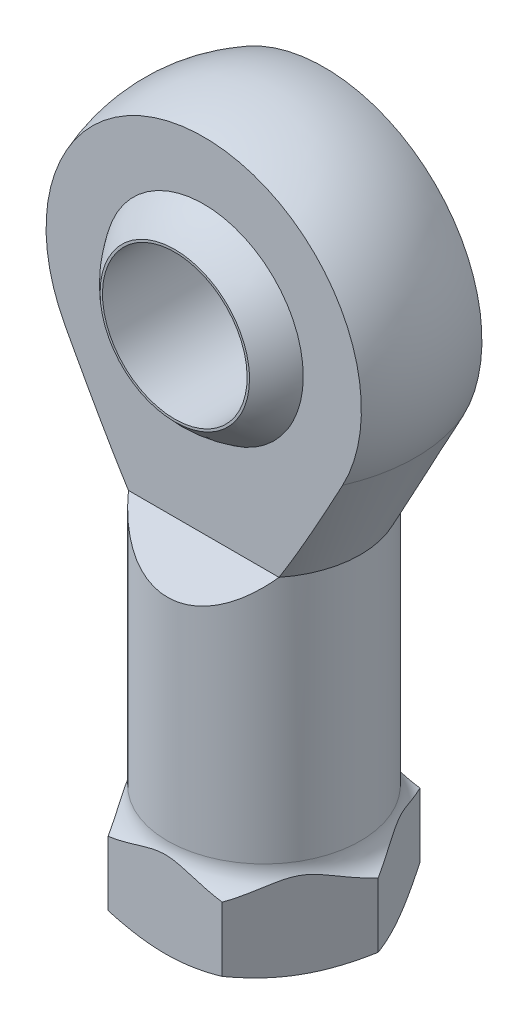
ISO-10303-21;
HEADER;
FILE_DESCRIPTION(('STEP AP214'),'2;1');
FILE_NAME('part.step','',(''),(''),'','','');
FILE_SCHEMA(('AUTOMOTIVE_DESIGN { 1 0 10303 214 1 1 1 1 }'));
ENDSEC;
DATA;
#1=APPLICATION_CONTEXT('core data for automotive mechanical design processes');
#2=APPLICATION_PROTOCOL_DEFINITION('international standard','automotive_design',2000,#1);
#3=PRODUCT_CONTEXT('',#1,'mechanical');
#4=PRODUCT('Part','Part','',(#3));
#5=PRODUCT_RELATED_PRODUCT_CATEGORY('part','',(#4));
#6=PRODUCT_DEFINITION_FORMATION('','',#4);
#7=PRODUCT_DEFINITION_CONTEXT('part definition',#1,'design');
#8=PRODUCT_DEFINITION('design','',#6,#7);
#9=PRODUCT_DEFINITION_SHAPE('','',#8);
#10=(LENGTH_UNIT() NAMED_UNIT(*) SI_UNIT(.MILLI.,.METRE.));
#11=(NAMED_UNIT(*) PLANE_ANGLE_UNIT() SI_UNIT($,.RADIAN.));
#12=(NAMED_UNIT(*) SI_UNIT($,.STERADIAN.) SOLID_ANGLE_UNIT());
#13=UNCERTAINTY_MEASURE_WITH_UNIT(LENGTH_MEASURE(1.E-05),#10,'distance_accuracy_value','');
#14=(GEOMETRIC_REPRESENTATION_CONTEXT(3) GLOBAL_UNCERTAINTY_ASSIGNED_CONTEXT((#13)) GLOBAL_UNIT_ASSIGNED_CONTEXT((#10,
#11,#12)) REPRESENTATION_CONTEXT('',''));
#15=CARTESIAN_POINT('',(0.,0.,0.));
#16=DIRECTION('',(0.,0.,1.));
#17=DIRECTION('',(1.,0.,0.));
#18=AXIS2_PLACEMENT_3D('',#15,#16,#17);
#19=CARTESIAN_POINT('',(0.,-23.8368286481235,0.));
#20=DIRECTION('',(0.,-1.,0.));
#21=DIRECTION('',(1.,0.,0.));
#22=AXIS2_PLACEMENT_3D('',#19,#20,#21);
#23=CYLINDRICAL_SURFACE('',#22,3.75);
#24=CARTESIAN_POINT('',(0.,-23.8368286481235,0.));
#25=DIRECTION('',(0.,-1.,0.));
#26=DIRECTION('',(1.,0.,0.));
#27=AXIS2_PLACEMENT_3D('',#24,#25,#26);
#28=CIRCLE('',#27,3.75);
#29=CARTESIAN_POINT('',(3.75,-23.8368286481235,0.));
#30=VERTEX_POINT('',#29);
#31=EDGE_CURVE('P0_E18',#30,#30,#28,.T.);
#32=ORIENTED_EDGE('',*,*,#31,.F.);
#33=EDGE_LOOP('',(#32));
#34=FACE_BOUND('',#33,.T.);
#35=CARTESIAN_POINT('',(0.,-41.9198729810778,0.));
#36=DIRECTION('',(0.,1.,0.));
#37=DIRECTION('',(0.,0.,1.));
#38=AXIS2_PLACEMENT_3D('',#35,#36,#37);
#39=CIRCLE('',#38,3.75000000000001);
#40=CARTESIAN_POINT('',(0.,-41.9198729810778,-3.75000000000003));
#41=VERTEX_POINT('',#40);
#42=EDGE_CURVE('P0_E386',#41,#41,#39,.T.);
#43=ORIENTED_EDGE('',*,*,#42,.F.);
#44=EDGE_LOOP('',(#43));
#45=FACE_BOUND('',#44,.T.);
#46=ADVANCED_FACE('P0_F15',(#34,#45),#23,.F.);
#47=CARTESIAN_POINT('',(0.,-46.25,0.));
#48=DIRECTION('',(0.,-1.,0.));
#49=DIRECTION('',(0.,0.,-1.));
#50=AXIS2_PLACEMENT_3D('',#47,#48,#49);
#51=CONICAL_SURFACE('',#50,11.25,1.0471975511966);
#52=CARTESIAN_POINT('',(0.,-46.25,0.));
#53=DIRECTION('',(0.,-1.,0.));
#54=DIRECTION('',(0.,0.,1.));
#55=AXIS2_PLACEMENT_3D('',#52,#53,#54);
#56=CIRCLE('',#55,11.25);
#57=CARTESIAN_POINT('',(0.,-46.25,-11.25));
#58=VERTEX_POINT('',#57);
#59=EDGE_CURVE('P0_E382',#58,#58,#56,.F.);
#60=CARTESIAN_POINT('',(0.,-46.25,-11.25));
#61=CARTESIAN_POINT('',(0.,-46.2048945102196,-11.171875));
#62=CARTESIAN_POINT('',(0.,-46.1597890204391,-11.09375));
#63=CARTESIAN_POINT('',(0.,-46.0695780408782,-10.9375));
#64=CARTESIAN_POINT('',(0.,-46.0244725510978,-10.859375));
#65=CARTESIAN_POINT('',(0.,-45.9342615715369,-10.703125));
#66=CARTESIAN_POINT('',(0.,-45.8891560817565,-10.625));
#67=CARTESIAN_POINT('',(0.,-45.7989451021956,-10.46875));
#68=CARTESIAN_POINT('',(0.,-45.7538396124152,-10.390625));
#69=CARTESIAN_POINT('',(0.,-45.6636286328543,-10.234375));
#70=CARTESIAN_POINT('',(0.,-45.6185231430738,-10.15625));
#71=CARTESIAN_POINT('',(0.,-45.528312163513,-10.));
#72=CARTESIAN_POINT('',(0.,-45.4832066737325,-9.92187500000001));
#73=CARTESIAN_POINT('',(0.,-45.3929956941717,-9.76562500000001));
#74=CARTESIAN_POINT('',(0.,-45.3478902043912,-9.68750000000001));
#75=CARTESIAN_POINT('',(0.,-45.2576792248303,-9.53125000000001));
#76=CARTESIAN_POINT('',(0.,-45.2125737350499,-9.45312500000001));
#77=CARTESIAN_POINT('',(0.,-45.122362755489,-9.29687500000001));
#78=CARTESIAN_POINT('',(0.,-45.0772572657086,-9.21875000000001));
#79=CARTESIAN_POINT('',(0.,-44.9870462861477,-9.06250000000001));
#80=CARTESIAN_POINT('',(0.,-44.9419407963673,-8.98437500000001));
#81=CARTESIAN_POINT('',(0.,-44.8517298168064,-8.82812500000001));
#82=CARTESIAN_POINT('',(0.,-44.8066243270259,-8.75000000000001));
#83=CARTESIAN_POINT('',(0.,-44.716413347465,-8.59375000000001));
#84=CARTESIAN_POINT('',(0.,-44.6713078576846,-8.51562500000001));
#85=CARTESIAN_POINT('',(0.,-44.5810968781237,-8.35937500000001));
#86=CARTESIAN_POINT('',(0.,-44.5359913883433,-8.28125000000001));
#87=CARTESIAN_POINT('',(0.,-44.4457804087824,-8.12500000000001));
#88=CARTESIAN_POINT('',(0.,-44.400674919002,-8.04687500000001));
#89=CARTESIAN_POINT('',(0.,-44.3104639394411,-7.89062500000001));
#90=CARTESIAN_POINT('',(0.,-44.2653584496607,-7.81250000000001));
#91=CARTESIAN_POINT('',(0.,-44.1751474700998,-7.65625000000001));
#92=CARTESIAN_POINT('',(0.,-44.1300419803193,-7.57812500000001));
#93=CARTESIAN_POINT('',(0.,-44.0398310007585,-7.42187500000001));
#94=CARTESIAN_POINT('',(0.,-43.994725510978,-7.34375000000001));
#95=CARTESIAN_POINT('',(0.,-43.9045145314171,-7.18750000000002));
#96=CARTESIAN_POINT('',(0.,-43.8594090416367,-7.10937500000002));
#97=CARTESIAN_POINT('',(0.,-43.7691980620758,-6.95312500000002));
#98=CARTESIAN_POINT('',(0.,-43.7240925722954,-6.87500000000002));
#99=CARTESIAN_POINT('',(0.,-43.6338815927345,-6.71875000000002));
#100=CARTESIAN_POINT('',(0.,-43.5887761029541,-6.64062500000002));
#101=CARTESIAN_POINT('',(0.,-43.4985651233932,-6.48437500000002));
#102=CARTESIAN_POINT('',(0.,-43.4534596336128,-6.40625000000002));
#103=CARTESIAN_POINT('',(0.,-43.3632486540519,-6.25000000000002));
#104=CARTESIAN_POINT('',(0.,-43.3181431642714,-6.17187500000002));
#105=CARTESIAN_POINT('',(0.,-43.2279321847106,-6.01562500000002));
#106=CARTESIAN_POINT('',(0.,-43.1828266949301,-5.93750000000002));
#107=CARTESIAN_POINT('',(0.,-43.0926157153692,-5.78125000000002));
#108=CARTESIAN_POINT('',(0.,-43.0475102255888,-5.70312500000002));
#109=CARTESIAN_POINT('',(0.,-42.9572992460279,-5.54687500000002));
#110=CARTESIAN_POINT('',(0.,-42.9121937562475,-5.46875000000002));
#111=CARTESIAN_POINT('',(0.,-42.8219827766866,-5.31250000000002));
#112=CARTESIAN_POINT('',(0.,-42.7768772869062,-5.23437500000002));
#113=CARTESIAN_POINT('',(0.,-42.6866663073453,-5.07812500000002));
#114=CARTESIAN_POINT('',(0.,-42.6415608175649,-5.00000000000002));
#115=CARTESIAN_POINT('',(0.,-42.551349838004,-4.84375000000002));
#116=CARTESIAN_POINT('',(0.,-42.5062443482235,-4.76562500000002));
#117=CARTESIAN_POINT('',(0.,-42.4160333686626,-4.60937500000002));
#118=CARTESIAN_POINT('',(0.,-42.3709278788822,-4.53125000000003));
#119=CARTESIAN_POINT('',(0.,-42.2807168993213,-4.37500000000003));
#120=CARTESIAN_POINT('',(0.,-42.2356114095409,-4.29687500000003));
#121=CARTESIAN_POINT('',(0.,-42.14540042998,-4.14062500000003));
#122=CARTESIAN_POINT('',(0.,-42.1002949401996,-4.06250000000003));
#123=CARTESIAN_POINT('',(0.,-42.0100839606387,-3.90625000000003));
#124=CARTESIAN_POINT('',(0.,-41.9649784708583,-3.82812500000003));
#125=CARTESIAN_POINT('',(0.,-41.9198729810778,-3.75000000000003));
#126=B_SPLINE_CURVE_WITH_KNOTS('',3,(#60,#61,#62,#63,#64,#65,#66,#67,#68,#69,#70,#71,#72,#73,
#74,#75,#76,#77,#78,#79,#80,#81,#82,#83,#84,#85,#86,#87,#88,#89,#90,#91,#92,#93,#94,#95,#96,#97,
#98,#99,#100,#101,#102,#103,#104,#105,#106,#107,#108,#109,#110,#111,#112,#113,#114,#115,#116,
#117,#118,#119,#120,#121,#122,#123,#124,#125),.UNSPECIFIED.,.F.,.F.,(4,2,2,2,2,2,2,2,2,2,2,2,2,
2,2,2,2,2,2,2,2,2,2,2,2,2,2,2,2,2,2,2,4),(0.,0.270632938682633,0.541265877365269,
0.811898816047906,1.08253175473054,1.35316469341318,1.62379763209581,1.89443057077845,
2.16506350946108,2.43569644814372,2.70632938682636,2.97696232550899,3.24759526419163,
3.51822820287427,3.7888611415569,4.05949408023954,4.33012701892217,4.60075995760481,
4.87139289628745,5.14202583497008,5.41265877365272,5.68329171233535,5.95392465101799,
6.22455758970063,6.49519052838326,6.7658234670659,7.03645640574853,7.30708934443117,
7.5777222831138,7.84835522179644,8.11898816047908,8.38962109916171,8.66025403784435),.UNSPECIFIED.);
#127=EDGE_CURVE('P0_BSEAM606',#58,#41,#126,.T.);
#128=ORIENTED_EDGE('',*,*,#59,.F.);
#129=ORIENTED_EDGE('',*,*,#42,.T.);
#130=ORIENTED_EDGE('',*,*,#127,.T.);
#131=ORIENTED_EDGE('',*,*,#127,.F.);
#132=EDGE_LOOP('',(#128,#130,#129,#131));
#133=FACE_BOUND('',#132,.T.);
#134=ADVANCED_FACE('P0_F606',(#133),#51,.F.);
#135=CARTESIAN_POINT('',(0.,0.,0.));
#136=DIRECTION('',(0.,0.,1.));
#137=DIRECTION('',(-1.,0.,0.));
#138=AXIS2_PLACEMENT_3D('',#135,#136,#137);
#139=SPHERICAL_SURFACE('',#138,24.13);
#140=CARTESIAN_POINT('',(0.,0.,-12.5));
#141=DIRECTION('',(0.,0.,1.));
#142=DIRECTION('',(1.,0.,0.));
#143=AXIS2_PLACEMENT_3D('',#140,#141,#142);
#144=CIRCLE('',#143,20.6399345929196);
#145=CARTESIAN_POINT('',(20.6399345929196,0.,-12.5));
#146=VERTEX_POINT('',#145);
#147=EDGE_CURVE('P0_E135',#146,#146,#144,.T.);
#148=ORIENTED_EDGE('',*,*,#147,.F.);
#149=EDGE_LOOP('',(#148));
#150=FACE_BOUND('',#149,.T.);
#151=CARTESIAN_POINT('',(0.,0.,12.5));
#152=DIRECTION('',(0.,0.,1.));
#153=DIRECTION('',(1.,0.,0.));
#154=AXIS2_PLACEMENT_3D('',#151,#152,#153);
#155=CIRCLE('',#154,20.6399345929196);
#156=CARTESIAN_POINT('',(20.6399345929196,0.,12.5));
#157=VERTEX_POINT('',#156);
#158=EDGE_CURVE('P0_E118',#157,#157,#155,.F.);
#159=ORIENTED_EDGE('',*,*,#158,.F.);
#160=EDGE_LOOP('',(#159));
#161=FACE_BOUND('',#160,.T.);
#162=ORIENTED_EDGE('',*,*,#31,.T.);
#163=EDGE_LOOP('',(#162));
#164=FACE_BOUND('',#163,.T.);
#165=ADVANCED_FACE('P0_F379',(#150,#161,#164),#139,.F.);
#166=CARTESIAN_POINT('',(0.,-46.25,0.));
#167=DIRECTION('',(0.,-1.,0.));
#168=DIRECTION('',(0.,0.,-1.));
#169=AXIS2_PLACEMENT_3D('',#166,#167,#168);
#170=CYLINDRICAL_SURFACE('',#169,11.25);
#171=CARTESIAN_POINT('',(0.,-110.,0.));
#172=DIRECTION('',(0.,-1.,0.));
#173=DIRECTION('',(0.,0.,-1.));
#174=AXIS2_PLACEMENT_3D('',#171,#172,#173);
#175=CIRCLE('',#174,11.25);
#176=CARTESIAN_POINT('',(0.,-110.,-11.25));
#177=VERTEX_POINT('',#176);
#178=EDGE_CURVE('P0_E128',#177,#177,#175,.F.);
#179=ORIENTED_EDGE('',*,*,#178,.F.);
#180=EDGE_LOOP('',(#179));
#181=FACE_BOUND('',#180,.T.);
#182=ORIENTED_EDGE('',*,*,#59,.T.);
#183=EDGE_LOOP('',(#182));
#184=FACE_BOUND('',#183,.T.);
#185=ADVANCED_FACE('P0_F183',(#181,#184),#170,.F.);
#186=CARTESIAN_POINT('',(32.6917420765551,-38.6,12.5));
#187=CARTESIAN_POINT('',(32.6917420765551,32.691742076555,12.5));
#188=CARTESIAN_POINT('',(32.6917420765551,33.4046594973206,12.5));
#189=B_SPLINE_CURVE_WITH_KNOTS('',1,(#186,#187,#188),.UNSPECIFIED.,.F.,.F.,(2,1,2),(0.,1.,1.01),.UNSPECIFIED.);
#190=DIRECTION('',(-1.,0.,0.));
#191=VECTOR('',#190,1.);
#192=SURFACE_OF_LINEAR_EXTRUSION('',#189,#191);
#193=ORIENTED_EDGE('',*,*,#158,.T.);
#194=EDGE_LOOP('',(#193));
#195=FACE_BOUND('',#194,.T.);
#196=CARTESIAN_POINT('',(28.8007923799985,-15.4681724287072,12.5));
#197=CARTESIAN_POINT('',(28.4506892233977,-16.120030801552,12.5));
#198=CARTESIAN_POINT('',(28.0998103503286,-16.7714732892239,12.5));
#199=CARTESIAN_POINT('',(27.3963402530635,-18.0733450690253,12.5));
#200=CARTESIAN_POINT('',(27.0437492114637,-18.7237744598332,12.5));
#201=CARTESIAN_POINT('',(26.3366554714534,-20.0235111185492,12.5));
#202=CARTESIAN_POINT('',(25.9821529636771,-20.6728184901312,12.5));
#203=CARTESIAN_POINT('',(25.2709948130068,-21.9701786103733,12.5));
#204=CARTESIAN_POINT('',(24.9143393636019,-22.6182314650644,12.5));
#205=CARTESIAN_POINT('',(24.198593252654,-23.9129279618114,12.5));
#206=CARTESIAN_POINT('',(23.8395027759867,-24.5595717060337,12.5));
#207=CARTESIAN_POINT('',(23.1185511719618,-25.8512661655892,12.5));
#208=CARTESIAN_POINT('',(22.7566902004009,-26.4963169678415,12.5));
#209=CARTESIAN_POINT('',(22.0297425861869,-27.7847004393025,12.5));
#210=CARTESIAN_POINT('',(21.6646555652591,-28.4280328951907,12.5));
#211=CARTESIAN_POINT('',(20.9308265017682,-29.7126112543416,12.5));
#212=CARTESIAN_POINT('',(20.5620844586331,-30.3538571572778,12.5));
#213=CARTESIAN_POINT('',(19.8203622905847,-31.6339185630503,12.5));
#214=CARTESIAN_POINT('',(19.4473820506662,-32.2727339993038,12.5));
#215=CARTESIAN_POINT('',(18.6964616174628,-33.5475080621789,12.5));
#216=CARTESIAN_POINT('',(18.3185210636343,-34.1834664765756,12.5));
#217=CARTESIAN_POINT('',(17.5567745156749,-35.4519962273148,12.5));
#218=CARTESIAN_POINT('',(17.1729676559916,-36.0845670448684,12.5));
#219=CARTESIAN_POINT('',(16.5920149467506,-37.0303204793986,12.5));
#220=CARTESIAN_POINT('',(16.3974632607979,-37.3450974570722,12.5));
#221=CARTESIAN_POINT('',(16.0064528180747,-37.973467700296,12.5));
#222=CARTESIAN_POINT('',(15.8099940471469,-38.2870609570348,12.5));
#223=CARTESIAN_POINT('',(15.612494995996,-38.6,12.5));
#224=B_SPLINE_CURVE_WITH_KNOTS('',3,(#196,#197,#198,#199,#200,#201,#202,#203,#204,#205,#206,
#207,#208,#209,#210,#211,#212,#213,#214,#215,#216,#217,#218,#219,#220,#221,#222,#223),
.UNSPECIFIED.,.F.,.F.,(4,2,2,2,2,2,2,2,2,2,2,2,2,4),(0.,2.21978061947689,4.43932949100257,
6.65866095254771,8.8777958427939,11.0967640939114,13.3156084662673,15.5347165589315,
17.7538249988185,19.9729937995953,22.1923248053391,24.4119864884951,25.5221219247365,
26.6322656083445),.UNSPECIFIED.);
#225=CARTESIAN_POINT('',(28.8007923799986,-15.4681724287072,12.5));
#226=VERTEX_POINT('',#225);
#227=CARTESIAN_POINT('',(15.612494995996,-38.6,12.5));
#228=VERTEX_POINT('',#227);
#229=EDGE_CURVE('P0_E122',#226,#228,#224,.T.);
#230=ORIENTED_EDGE('',*,*,#229,.F.);
#231=CARTESIAN_POINT('',(0.,0.,12.5));
#232=DIRECTION('',(0.,0.,1.));
#233=DIRECTION('',(1.,0.,0.));
#234=AXIS2_PLACEMENT_3D('',#231,#232,#233);
#235=CIRCLE('',#234,32.6917420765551);
#236=CARTESIAN_POINT('',(-28.8007923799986,-15.4681724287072,12.5));
#237=VERTEX_POINT('',#236);
#238=EDGE_CURVE('P0_E108',#237,#226,#235,.F.);
#239=ORIENTED_EDGE('',*,*,#238,.F.);
#240=CARTESIAN_POINT('',(-15.612494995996,-38.6,12.5));
#241=CARTESIAN_POINT('',(-15.8099940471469,-38.2870609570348,12.5));
#242=CARTESIAN_POINT('',(-16.0064528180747,-37.973467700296,12.5));
#243=CARTESIAN_POINT('',(-16.397463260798,-37.3450974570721,12.5));
#244=CARTESIAN_POINT('',(-16.5920149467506,-37.0303204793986,12.5));
#245=CARTESIAN_POINT('',(-17.1729676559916,-36.0845670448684,12.5));
#246=CARTESIAN_POINT('',(-17.5567745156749,-35.4519962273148,12.5));
#247=CARTESIAN_POINT('',(-18.3185210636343,-34.1834664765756,12.5));
#248=CARTESIAN_POINT('',(-18.6964616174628,-33.5475080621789,12.5));
#249=CARTESIAN_POINT('',(-19.4473820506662,-32.2727339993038,12.5));
#250=CARTESIAN_POINT('',(-19.8203622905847,-31.6339185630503,12.5));
#251=CARTESIAN_POINT('',(-20.5620844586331,-30.3538571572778,12.5));
#252=CARTESIAN_POINT('',(-20.9308265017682,-29.7126112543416,12.5));
#253=CARTESIAN_POINT('',(-21.6646555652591,-28.4280328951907,12.5));
#254=CARTESIAN_POINT('',(-22.0297425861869,-27.7847004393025,12.5));
#255=CARTESIAN_POINT('',(-22.7566902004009,-26.4963169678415,12.5));
#256=CARTESIAN_POINT('',(-23.1185511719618,-25.8512661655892,12.5));
#257=CARTESIAN_POINT('',(-23.8395027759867,-24.5595717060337,12.5));
#258=CARTESIAN_POINT('',(-24.198593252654,-23.9129279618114,12.5));
#259=CARTESIAN_POINT('',(-24.9143393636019,-22.6182314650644,12.5));
#260=CARTESIAN_POINT('',(-25.2709948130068,-21.9701786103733,12.5));
#261=CARTESIAN_POINT('',(-25.9821529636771,-20.6728184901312,12.5));
#262=CARTESIAN_POINT('',(-26.3366554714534,-20.0235111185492,12.5));
#263=CARTESIAN_POINT('',(-27.0437492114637,-18.7237744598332,12.5));
#264=CARTESIAN_POINT('',(-27.3963402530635,-18.0733450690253,12.5));
#265=CARTESIAN_POINT('',(-28.0998103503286,-16.7714732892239,12.5));
#266=CARTESIAN_POINT('',(-28.4506892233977,-16.1200308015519,12.5));
#267=CARTESIAN_POINT('',(-28.8007923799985,-15.4681724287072,12.5));
#268=B_SPLINE_CURVE_WITH_KNOTS('',3,(#240,#241,#242,#243,#244,#245,#246,#247,#248,#249,#250,
#251,#252,#253,#254,#255,#256,#257,#258,#259,#260,#261,#262,#263,#264,#265,#266,#267),
.UNSPECIFIED.,.F.,.F.,(4,2,2,2,2,2,2,2,2,2,2,2,2,4),(0.,1.11014368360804,2.22027911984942,
4.4399408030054,6.65927180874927,8.87844060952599,11.097549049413,13.3166571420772,
15.5355015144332,17.7544697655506,19.9736046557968,22.192936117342,24.4124849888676,
26.6322656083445),.UNSPECIFIED.);
#269=CARTESIAN_POINT('',(-15.612494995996,-38.6,12.5));
#270=VERTEX_POINT('',#269);
#271=EDGE_CURVE('P0_E188',#270,#237,#268,.T.);
#272=ORIENTED_EDGE('',*,*,#271,.F.);
#273=DIRECTION('',(-1.,0.,0.));
#274=VECTOR('',#273,1.);
#275=CARTESIAN_POINT('',(15.612494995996,-38.6,12.5));
#276=LINE('',#275,#274);
#277=EDGE_CURVE('P0_E125',#228,#270,#276,.T.);
#278=ORIENTED_EDGE('',*,*,#277,.F.);
#279=EDGE_LOOP('',(#230,#239,#272,#278));
#280=FACE_BOUND('',#279,.T.);
#281=ADVANCED_FACE('P0_F123',(#195,#280),#192,.T.);
#282=CARTESIAN_POINT('',(0.,0.,0.));
#283=DIRECTION('',(0.,0.,1.));
#284=DIRECTION('',(1.,0.,0.));
#285=AXIS2_PLACEMENT_3D('',#282,#283,#284);
#286=SPHERICAL_SURFACE('',#285,35.);
#287=CARTESIAN_POINT('',(0.,-15.4681724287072,0.));
#288=DIRECTION('',(0.,1.,0.));
#289=DIRECTION('',(0.,0.,1.));
#290=AXIS2_PLACEMENT_3D('',#287,#288,#289);
#291=CIRCLE('',#290,31.3964272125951);
#292=CARTESIAN_POINT('',(-28.8007923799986,-15.4681724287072,-12.5));
#293=VERTEX_POINT('',#292);
#294=EDGE_CURVE('P0_E106',#237,#293,#291,.F.);
#295=ORIENTED_EDGE('',*,*,#294,.F.);
#296=ORIENTED_EDGE('',*,*,#238,.T.);
#297=CARTESIAN_POINT('',(0.,-15.4681724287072,0.));
#298=DIRECTION('',(0.,1.,0.));
#299=DIRECTION('',(0.,0.,1.));
#300=AXIS2_PLACEMENT_3D('',#297,#298,#299);
#301=CIRCLE('',#300,31.3964272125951);
#302=CARTESIAN_POINT('',(28.8007923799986,-15.4681724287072,-12.5));
#303=VERTEX_POINT('',#302);
#304=EDGE_CURVE('P0_E112',#303,#226,#301,.F.);
#305=ORIENTED_EDGE('',*,*,#304,.F.);
#306=CARTESIAN_POINT('',(0.,0.,-12.5));
#307=DIRECTION('',(0.,0.,1.));
#308=DIRECTION('',(1.,0.,0.));
#309=AXIS2_PLACEMENT_3D('',#306,#307,#308);
#310=CIRCLE('',#309,32.6917420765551);
#311=EDGE_CURVE('P0_E117',#293,#303,#310,.F.);
#312=ORIENTED_EDGE('',*,*,#311,.F.);
#313=EDGE_LOOP('',(#295,#296,#305,#312));
#314=FACE_BOUND('',#313,.T.);
#315=ADVANCED_FACE('P0_F110',(#314),#286,.T.);
#316=CARTESIAN_POINT('',(32.6917420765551,33.4046594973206,-12.5));
#317=CARTESIAN_POINT('',(32.6917420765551,32.691742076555,-12.5));
#318=CARTESIAN_POINT('',(32.6917420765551,-38.6,-12.5));
#319=B_SPLINE_CURVE_WITH_KNOTS('',1,(#316,#317,#318),.UNSPECIFIED.,.F.,.F.,(2,1,2),(-0.01,0.,
1.),.UNSPECIFIED.);
#320=DIRECTION('',(-1.,0.,0.));
#321=VECTOR('',#320,1.);
#322=SURFACE_OF_LINEAR_EXTRUSION('',#319,#321);
#323=ORIENTED_EDGE('',*,*,#147,.T.);
#324=EDGE_LOOP('',(#323));
#325=FACE_BOUND('',#324,.T.);
#326=CARTESIAN_POINT('',(-28.8007923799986,-15.4681724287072,-12.5));
#327=CARTESIAN_POINT('',(-28.4506892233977,-16.120030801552,-12.5));
#328=CARTESIAN_POINT('',(-28.0998103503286,-16.7714732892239,-12.5));
#329=CARTESIAN_POINT('',(-27.3963402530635,-18.0733450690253,-12.5));
#330=CARTESIAN_POINT('',(-27.0437492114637,-18.7237744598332,-12.5));
#331=CARTESIAN_POINT('',(-26.3366554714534,-20.0235111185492,-12.5));
#332=CARTESIAN_POINT('',(-25.9821529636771,-20.6728184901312,-12.5));
#333=CARTESIAN_POINT('',(-25.2709948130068,-21.9701786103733,-12.5));
#334=CARTESIAN_POINT('',(-24.9143393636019,-22.6182314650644,-12.5));
#335=CARTESIAN_POINT('',(-24.198593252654,-23.9129279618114,-12.5));
#336=CARTESIAN_POINT('',(-23.8395027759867,-24.5595717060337,-12.5));
#337=CARTESIAN_POINT('',(-23.1185511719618,-25.8512661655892,-12.5));
#338=CARTESIAN_POINT('',(-22.7566902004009,-26.4963169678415,-12.5));
#339=CARTESIAN_POINT('',(-22.0297425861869,-27.7847004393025,-12.5));
#340=CARTESIAN_POINT('',(-21.6646555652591,-28.4280328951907,-12.5));
#341=CARTESIAN_POINT('',(-20.9308265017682,-29.7126112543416,-12.5));
#342=CARTESIAN_POINT('',(-20.5620844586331,-30.3538571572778,-12.5));
#343=CARTESIAN_POINT('',(-19.8203622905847,-31.6339185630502,-12.5));
#344=CARTESIAN_POINT('',(-19.4473820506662,-32.2727339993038,-12.5));
#345=CARTESIAN_POINT('',(-18.6964616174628,-33.5475080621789,-12.5));
#346=CARTESIAN_POINT('',(-18.3185210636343,-34.1834664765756,-12.5));
#347=CARTESIAN_POINT('',(-17.5567745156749,-35.4519962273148,-12.5));
#348=CARTESIAN_POINT('',(-17.1729676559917,-36.0845670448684,-12.5));
#349=CARTESIAN_POINT('',(-16.5920149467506,-37.0303204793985,-12.5));
#350=CARTESIAN_POINT('',(-16.397463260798,-37.3450974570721,-12.5));
#351=CARTESIAN_POINT('',(-16.0064528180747,-37.973467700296,-12.5));
#352=CARTESIAN_POINT('',(-15.8099940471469,-38.2870609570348,-12.5));
#353=CARTESIAN_POINT('',(-15.612494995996,-38.6,-12.5));
#354=B_SPLINE_CURVE_WITH_KNOTS('',3,(#326,#327,#328,#329,#330,#331,#332,#333,#334,#335,#336,
#337,#338,#339,#340,#341,#342,#343,#344,#345,#346,#347,#348,#349,#350,#351,#352,#353),
.UNSPECIFIED.,.F.,.F.,(4,2,2,2,2,2,2,2,2,2,2,2,2,4),(0.,2.21978061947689,4.43932949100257,
6.65866095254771,8.8777958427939,11.0967640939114,13.3156084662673,15.5347165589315,
17.7538249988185,19.9729937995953,22.1923248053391,24.4119864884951,25.5221219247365,
26.6322656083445),.UNSPECIFIED.);
#355=CARTESIAN_POINT('',(-15.612494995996,-38.6,-12.5));
#356=VERTEX_POINT('',#355);
#357=EDGE_CURVE('P0_E207',#293,#356,#354,.T.);
#358=ORIENTED_EDGE('',*,*,#357,.F.);
#359=ORIENTED_EDGE('',*,*,#311,.T.);
#360=CARTESIAN_POINT('',(15.612494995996,-38.6,-12.5));
#361=CARTESIAN_POINT('',(15.8099940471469,-38.2870609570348,-12.5));
#362=CARTESIAN_POINT('',(16.0064528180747,-37.973467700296,-12.5));
#363=CARTESIAN_POINT('',(16.397463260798,-37.3450974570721,-12.5));
#364=CARTESIAN_POINT('',(16.5920149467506,-37.0303204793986,-12.5));
#365=CARTESIAN_POINT('',(17.1729676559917,-36.0845670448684,-12.5));
#366=CARTESIAN_POINT('',(17.5567745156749,-35.4519962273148,-12.5));
#367=CARTESIAN_POINT('',(18.3185210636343,-34.1834664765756,-12.5));
#368=CARTESIAN_POINT('',(18.6964616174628,-33.5475080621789,-12.5));
#369=CARTESIAN_POINT('',(19.4473820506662,-32.2727339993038,-12.5));
#370=CARTESIAN_POINT('',(19.8203622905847,-31.6339185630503,-12.5));
#371=CARTESIAN_POINT('',(20.5620844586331,-30.3538571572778,-12.5));
#372=CARTESIAN_POINT('',(20.9308265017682,-29.7126112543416,-12.5));
#373=CARTESIAN_POINT('',(21.6646555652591,-28.4280328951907,-12.5));
#374=CARTESIAN_POINT('',(22.0297425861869,-27.7847004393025,-12.5));
#375=CARTESIAN_POINT('',(22.7566902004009,-26.4963169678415,-12.5));
#376=CARTESIAN_POINT('',(23.1185511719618,-25.8512661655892,-12.5));
#377=CARTESIAN_POINT('',(23.8395027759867,-24.5595717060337,-12.5));
#378=CARTESIAN_POINT('',(24.198593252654,-23.9129279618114,-12.5));
#379=CARTESIAN_POINT('',(24.9143393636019,-22.6182314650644,-12.5));
#380=CARTESIAN_POINT('',(25.2709948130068,-21.9701786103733,-12.5));
#381=CARTESIAN_POINT('',(25.9821529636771,-20.6728184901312,-12.5));
#382=CARTESIAN_POINT('',(26.3366554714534,-20.0235111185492,-12.5));
#383=CARTESIAN_POINT('',(27.0437492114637,-18.7237744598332,-12.5));
#384=CARTESIAN_POINT('',(27.3963402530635,-18.0733450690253,-12.5));
#385=CARTESIAN_POINT('',(28.0998103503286,-16.7714732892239,-12.5));
#386=CARTESIAN_POINT('',(28.4506892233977,-16.120030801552,-12.5));
#387=CARTESIAN_POINT('',(28.8007923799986,-15.4681724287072,-12.5));
#388=B_SPLINE_CURVE_WITH_KNOTS('',3,(#360,#361,#362,#363,#364,#365,#366,#367,#368,#369,#370,
#371,#372,#373,#374,#375,#376,#377,#378,#379,#380,#381,#382,#383,#384,#385,#386,#387),
.UNSPECIFIED.,.F.,.F.,(4,2,2,2,2,2,2,2,2,2,2,2,2,4),(0.,1.11014368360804,2.22027911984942,
4.4399408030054,6.65927180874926,8.87844060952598,11.097549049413,13.3166571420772,
15.5355015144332,17.7544697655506,19.9736046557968,22.192936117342,24.4124849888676,
26.6322656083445),.UNSPECIFIED.);
#389=CARTESIAN_POINT('',(15.612494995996,-38.6,-12.5));
#390=VERTEX_POINT('',#389);
#391=EDGE_CURVE('P0_E133',#390,#303,#388,.T.);
#392=ORIENTED_EDGE('',*,*,#391,.F.);
#393=DIRECTION('',(-1.,0.,0.));
#394=VECTOR('',#393,1.);
#395=CARTESIAN_POINT('',(15.612494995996,-38.6,-12.5));
#396=LINE('',#395,#394);
#397=EDGE_CURVE('P0_E213',#356,#390,#396,.F.);
#398=ORIENTED_EDGE('',*,*,#397,.F.);
#399=EDGE_LOOP('',(#358,#359,#392,#398));
#400=FACE_BOUND('',#399,.T.);
#401=ADVANCED_FACE('P0_F151',(#325,#400),#322,.T.);
#402=CARTESIAN_POINT('',(0.,-38.6,0.));
#403=DIRECTION('',(0.,1.,0.));
#404=DIRECTION('',(0.,0.,1.));
#405=AXIS2_PLACEMENT_3D('',#402,#403,#404);
#406=CONICAL_SURFACE('',#405,20.,0.457768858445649);
#407=ORIENTED_EDGE('',*,*,#229,.T.);
#408=CARTESIAN_POINT('',(0.,-38.6,0.));
#409=DIRECTION('',(0.,-1.,0.));
#410=DIRECTION('',(0.,0.,1.));
#411=AXIS2_PLACEMENT_3D('',#408,#409,#410);
#412=CIRCLE('',#411,20.);
#413=EDGE_CURVE('P0_E221',#390,#228,#412,.T.);
#414=ORIENTED_EDGE('',*,*,#413,.F.);
#415=ORIENTED_EDGE('',*,*,#391,.T.);
#416=ORIENTED_EDGE('',*,*,#304,.T.);
#417=EDGE_LOOP('',(#407,#414,#415,#416));
#418=FACE_BOUND('',#417,.T.);
#419=ADVANCED_FACE('P0_F131',(#418),#406,.T.);
#420=CARTESIAN_POINT('',(20.746001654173,-110.,-20.5));
#421=DIRECTION('',(0.,-1.,0.));
#422=DIRECTION('',(0.,0.,1.));
#423=AXIS2_PLACEMENT_3D('',#420,#421,#422);
#424=PLANE('',#423);
#425=ORIENTED_EDGE('',*,*,#178,.T.);
#426=EDGE_LOOP('',(#425));
#427=FACE_BOUND('',#426,.T.);
#428=CARTESIAN_POINT('',(0.,-110.,0.));
#429=DIRECTION('',(0.,1.,0.));
#430=DIRECTION('',(0.,0.,1.));
#431=AXIS2_PLACEMENT_3D('',#428,#429,#430);
#432=CIRCLE('',#431,20.5);
#433=CARTESIAN_POINT('',(17.753520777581,-110.,10.25));
#434=VERTEX_POINT('',#433);
#435=CARTESIAN_POINT('',(17.753520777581,-110.,-10.25));
#436=VERTEX_POINT('',#435);
#437=EDGE_CURVE('P0_E195',#434,#436,#432,.T.);
#438=ORIENTED_EDGE('',*,*,#437,.F.);
#439=CARTESIAN_POINT('',(0.,-110.,0.));
#440=DIRECTION('',(0.,1.,0.));
#441=DIRECTION('',(0.,0.,1.));
#442=AXIS2_PLACEMENT_3D('',#439,#440,#441);
#443=CIRCLE('',#442,20.5);
#444=CARTESIAN_POINT('',(0.,-110.,20.5));
#445=VERTEX_POINT('',#444);
#446=EDGE_CURVE('P0_E684',#445,#434,#443,.T.);
#447=ORIENTED_EDGE('',*,*,#446,.F.);
#448=CARTESIAN_POINT('',(0.,-110.,0.));
#449=DIRECTION('',(0.,1.,0.));
#450=DIRECTION('',(0.,0.,1.));
#451=AXIS2_PLACEMENT_3D('',#448,#449,#450);
#452=CIRCLE('',#451,20.5);
#453=CARTESIAN_POINT('',(-17.753520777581,-110.,10.25));
#454=VERTEX_POINT('',#453);
#455=EDGE_CURVE('P0_E683',#454,#445,#452,.T.);
#456=ORIENTED_EDGE('',*,*,#455,.F.);
#457=CARTESIAN_POINT('',(0.,-110.,0.));
#458=DIRECTION('',(0.,1.,0.));
#459=DIRECTION('',(0.,0.,1.));
#460=AXIS2_PLACEMENT_3D('',#457,#458,#459);
#461=CIRCLE('',#460,20.5);
#462=CARTESIAN_POINT('',(-17.753520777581,-110.,-10.25));
#463=VERTEX_POINT('',#462);
#464=EDGE_CURVE('P0_E450',#463,#454,#461,.T.);
#465=ORIENTED_EDGE('',*,*,#464,.F.);
#466=CARTESIAN_POINT('',(0.,-110.,0.));
#467=DIRECTION('',(0.,1.,0.));
#468=DIRECTION('',(0.,0.,1.));
#469=AXIS2_PLACEMENT_3D('',#466,#467,#468);
#470=CIRCLE('',#469,20.5);
#471=CARTESIAN_POINT('',(0.,-110.,-20.5));
#472=VERTEX_POINT('',#471);
#473=EDGE_CURVE('P0_E686',#472,#463,#470,.T.);
#474=ORIENTED_EDGE('',*,*,#473,.F.);
#475=CARTESIAN_POINT('',(0.,-110.,0.));
#476=DIRECTION('',(0.,1.,0.));
#477=DIRECTION('',(0.,0.,1.));
#478=AXIS2_PLACEMENT_3D('',#475,#476,#477);
#479=CIRCLE('',#478,20.5);
#480=EDGE_CURVE('P0_E354',#436,#472,#479,.T.);
#481=ORIENTED_EDGE('',*,*,#480,.F.);
#482=EDGE_LOOP('',(#438,#447,#456,#465,#474,#481));
#483=FACE_BOUND('',#482,.T.);
#484=ADVANCED_FACE('P0_F232',(#427,#483),#424,.T.);
#485=CARTESIAN_POINT('',(0.,-110.,0.));
#486=DIRECTION('',(0.,1.,0.));
#487=DIRECTION('',(0.,0.,1.));
#488=AXIS2_PLACEMENT_3D('',#485,#486,#487);
#489=CONICAL_SURFACE('',#488,20.5,1.0471975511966);
#490=ORIENTED_EDGE('',*,*,#437,.T.);
#491=CARTESIAN_POINT('',(23.6713610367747,-108.169013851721,0.));
#492=CARTESIAN_POINT('',(23.4304140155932,-108.308114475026,-0.417332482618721));
#493=CARTESIAN_POINT('',(23.188599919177,-108.441364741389,-0.836166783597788));
#494=CARTESIAN_POINT('',(22.7031900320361,-108.694661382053,-1.67692137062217));
#495=CARTESIAN_POINT('',(22.4595938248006,-108.814704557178,-2.09884237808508));
#496=CARTESIAN_POINT('',(21.9719352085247,-109.039440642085,-2.94349187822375));
#497=CARTESIAN_POINT('',(21.7278815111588,-109.144208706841,-3.36620528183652));
#498=CARTESIAN_POINT('',(21.2381837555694,-109.337550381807,-4.21438667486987));
#499=CARTESIAN_POINT('',(20.9925397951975,-109.426124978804,-4.63985449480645));
#500=CARTESIAN_POINT('',(20.4995141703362,-109.585677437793,-5.49379992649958));
#501=CARTESIAN_POINT('',(20.2521307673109,-109.656633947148,-5.92228054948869));
#502=CARTESIAN_POINT('',(19.7561831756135,-109.779451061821,-6.78128697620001));
#503=CARTESIAN_POINT('',(19.5076190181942,-109.831312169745,-7.21181272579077));
#504=CARTESIAN_POINT('',(19.0083799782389,-109.91505987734,-8.07652010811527));
#505=CARTESIAN_POINT('',(18.7577007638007,-109.946844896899,-8.51070924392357));
#506=CARTESIAN_POINT('',(18.3813369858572,-109.978700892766,-9.16259042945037));
#507=CARTESIAN_POINT('',(18.2558094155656,-109.986682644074,-9.38001055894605));
#508=CARTESIAN_POINT('',(18.0046961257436,-109.997334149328,-9.81495153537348));
#509=CARTESIAN_POINT('',(17.8791104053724,-110.000003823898,-10.0324723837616));
#510=CARTESIAN_POINT('',(17.753520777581,-110.,-10.25));
#511=B_SPLINE_CURVE_WITH_KNOTS('',3,(#491,#492,#493,#494,#495,#496,#497,#498,#499,#500,#501,
#502,#503,#504,#505,#506,#507,#508,#509,#510),.UNSPECIFIED.,.F.,.F.,(4,2,2,2,2,2,2,2,2,4),(0.,
1.50473319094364,3.00983007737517,4.50725193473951,6.0045825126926,7.50371905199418,
9.00281613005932,10.5094387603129,11.2629357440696,12.0164439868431),.UNSPECIFIED.);
#512=CARTESIAN_POINT('',(23.6713610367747,-108.169013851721,0.));
#513=VERTEX_POINT('',#512);
#514=EDGE_CURVE('P0_E214',#513,#436,#511,.T.);
#515=ORIENTED_EDGE('',*,*,#514,.F.);
#516=CARTESIAN_POINT('',(17.753520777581,-110.,10.25));
#517=CARTESIAN_POINT('',(17.8791104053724,-110.000003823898,10.0324723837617));
#518=CARTESIAN_POINT('',(18.0046961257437,-109.997334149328,9.81495153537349));
#519=CARTESIAN_POINT('',(18.2558094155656,-109.986682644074,9.38001055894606));
#520=CARTESIAN_POINT('',(18.3813369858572,-109.978700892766,9.16259042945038));
#521=CARTESIAN_POINT('',(18.7577007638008,-109.946844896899,8.51070924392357));
#522=CARTESIAN_POINT('',(19.0083799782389,-109.91505987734,8.07652010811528));
#523=CARTESIAN_POINT('',(19.5076190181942,-109.831312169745,7.21181272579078));
#524=CARTESIAN_POINT('',(19.7561831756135,-109.779451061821,6.78128697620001));
#525=CARTESIAN_POINT('',(20.2521307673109,-109.656633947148,5.9222805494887));
#526=CARTESIAN_POINT('',(20.4995141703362,-109.585677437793,5.49379992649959));
#527=CARTESIAN_POINT('',(20.9925397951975,-109.426124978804,4.63985449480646));
#528=CARTESIAN_POINT('',(21.2381837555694,-109.337550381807,4.21438667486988));
#529=CARTESIAN_POINT('',(21.7278815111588,-109.144208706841,3.36620528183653));
#530=CARTESIAN_POINT('',(21.9719352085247,-109.039440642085,2.94349187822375));
#531=CARTESIAN_POINT('',(22.4595938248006,-108.814704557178,2.09884237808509));
#532=CARTESIAN_POINT('',(22.7031900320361,-108.694661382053,1.67692137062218));
#533=CARTESIAN_POINT('',(23.188599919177,-108.441364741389,0.836166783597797));
#534=CARTESIAN_POINT('',(23.4304140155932,-108.308114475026,0.417332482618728));
#535=CARTESIAN_POINT('',(23.6713610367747,-108.169013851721,0.));
#536=B_SPLINE_CURVE_WITH_KNOTS('',3,(#516,#517,#518,#519,#520,#521,#522,#523,#524,#525,#526,
#527,#528,#529,#530,#531,#532,#533,#534,#535),.UNSPECIFIED.,.F.,.F.,(4,2,2,2,2,2,2,2,2,4),(0.,
0.75350824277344,1.50700522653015,3.01362785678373,4.51272493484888,6.01186147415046,
7.50919205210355,9.00661390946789,10.5117107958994,12.0164439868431),.UNSPECIFIED.);
#537=EDGE_CURVE('P0_E236',#434,#513,#536,.T.);
#538=ORIENTED_EDGE('',*,*,#537,.F.);
#539=EDGE_LOOP('',(#490,#515,#538));
#540=FACE_BOUND('',#539,.T.);
#541=ADVANCED_FACE('P0_F229',(#540),#489,.T.);
#542=CARTESIAN_POINT('',(15.799844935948,-46.25,20.));
#543=DIRECTION('',(0.,0.700071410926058,0.714072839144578));
#544=DIRECTION('',(0.,0.714072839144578,-0.700071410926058));
#545=AXIS2_PLACEMENT_3D('',#542,#543,#544);
#546=PLANE('',#545);
#547=ORIENTED_EDGE('',*,*,#277,.T.);
#548=CARTESIAN_POINT('',(0.,-25.85,0.));
#549=DIRECTION('',(0.,0.700071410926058,0.714072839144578));
#550=DIRECTION('',(0.,-0.714072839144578,0.700071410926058));
#551=AXIS2_PLACEMENT_3D('',#548,#549,#550);
#552=ELLIPSE('',#551,28.5685141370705,20.);
#553=EDGE_CURVE('P0_E246',#228,#270,#552,.F.);
#554=ORIENTED_EDGE('',*,*,#553,.F.);
#555=EDGE_LOOP('',(#547,#554));
#556=FACE_BOUND('',#555,.T.);
#557=ADVANCED_FACE('P0_F202',(#556),#546,.T.);
#558=CARTESIAN_POINT('',(0.,-38.6,0.));
#559=DIRECTION('',(0.,1.,0.));
#560=DIRECTION('',(0.,0.,1.));
#561=AXIS2_PLACEMENT_3D('',#558,#559,#560);
#562=CONICAL_SURFACE('',#561,20.,0.457768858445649);
#563=ORIENTED_EDGE('',*,*,#357,.T.);
#564=CARTESIAN_POINT('',(0.,-38.6,0.));
#565=DIRECTION('',(0.,-1.,0.));
#566=DIRECTION('',(0.,0.,1.));
#567=AXIS2_PLACEMENT_3D('',#564,#565,#566);
#568=CIRCLE('',#567,20.);
#569=EDGE_CURVE('P0_E320',#270,#356,#568,.T.);
#570=ORIENTED_EDGE('',*,*,#569,.F.);
#571=ORIENTED_EDGE('',*,*,#271,.T.);
#572=ORIENTED_EDGE('',*,*,#294,.T.);
#573=EDGE_LOOP('',(#563,#570,#571,#572));
#574=FACE_BOUND('',#573,.T.);
#575=ADVANCED_FACE('P0_F196',(#574),#562,.T.);
#576=CARTESIAN_POINT('',(15.799844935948,-38.6,-12.5));
#577=DIRECTION('',(0.,0.700071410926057,-0.714072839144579));
#578=DIRECTION('',(0.,-0.714072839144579,-0.700071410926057));
#579=AXIS2_PLACEMENT_3D('',#576,#577,#578);
#580=PLANE('',#579);
#581=ORIENTED_EDGE('',*,*,#397,.T.);
#582=CARTESIAN_POINT('',(0.,-25.85,0.));
#583=DIRECTION('',(0.,0.700071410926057,-0.714072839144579));
#584=DIRECTION('',(0.,-0.714072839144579,-0.700071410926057));
#585=AXIS2_PLACEMENT_3D('',#582,#583,#584);
#586=ELLIPSE('',#585,28.5685141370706,20.);
#587=EDGE_CURVE('P0_E274',#356,#390,#586,.F.);
#588=ORIENTED_EDGE('',*,*,#587,.F.);
#589=EDGE_LOOP('',(#581,#588));
#590=FACE_BOUND('',#589,.T.);
#591=ADVANCED_FACE('P0_F201',(#590),#580,.T.);
#592=CARTESIAN_POINT('',(23.6713610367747,-110.106923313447,0.));
#593=DIRECTION('',(0.866025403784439,0.,-0.5));
#594=DIRECTION('',(-0.5,0.,-0.866025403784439));
#595=AXIS2_PLACEMENT_3D('',#592,#593,#594);
#596=PLANE('',#595);
#597=CARTESIAN_POINT('',(11.8356805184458,-108.169013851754,-20.4999999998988));
#598=CARTESIAN_POINT('',(12.0766275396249,-108.308114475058,-20.0826675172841));
#599=CARTESIAN_POINT('',(12.3184416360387,-108.441364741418,-19.663833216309));
#600=CARTESIAN_POINT('',(12.803851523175,-108.694661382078,-18.8230786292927));
#601=CARTESIAN_POINT('',(13.0474477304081,-108.8147045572,-18.4011576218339));
#602=CARTESIAN_POINT('',(13.5351063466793,-109.039440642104,-17.5565081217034));
#603=CARTESIAN_POINT('',(13.7791600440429,-109.144208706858,-17.1337947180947));
#604=CARTESIAN_POINT('',(14.2688577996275,-109.33755038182,-16.2856133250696));
#605=CARTESIAN_POINT('',(14.514501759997,-109.426124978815,-15.8601455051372));
#606=CARTESIAN_POINT('',(15.0075273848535,-109.585677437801,-15.0062000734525));
#607=CARTESIAN_POINT('',(15.2549107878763,-109.656633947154,-14.5777194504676));
#608=CARTESIAN_POINT('',(15.7508583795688,-109.779451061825,-13.7187130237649));
#609=CARTESIAN_POINT('',(15.9994225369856,-109.831312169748,-13.2881872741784));
#610=CARTESIAN_POINT('',(16.4986615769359,-109.915059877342,-12.4234798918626));
#611=CARTESIAN_POINT('',(16.7493407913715,-109.9468448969,-11.9892907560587));
#612=CARTESIAN_POINT('',(17.1257045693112,-109.978700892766,-11.3374095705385));
#613=CARTESIAN_POINT('',(17.2512321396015,-109.986682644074,-11.1199894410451));
#614=CARTESIAN_POINT('',(17.5023454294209,-109.997334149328,-10.6850484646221));
#615=CARTESIAN_POINT('',(17.6279311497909,-110.000003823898,-10.4675276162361));
#616=CARTESIAN_POINT('',(17.753520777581,-110.,-10.25));
#617=B_SPLINE_CURVE_WITH_KNOTS('',3,(#597,#598,#599,#600,#601,#602,#603,#604,#605,#606,#607,
#608,#609,#610,#611,#612,#613,#614,#615,#616),.UNSPECIFIED.,.F.,.F.,(4,2,2,2,2,2,2,2,2,4),(0.,
1.5047331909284,3.00983007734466,4.50725193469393,6.00458251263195,7.50371905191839,
9.00281612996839,10.5094387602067,11.2629357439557,12.0164439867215),.UNSPECIFIED.);
#618=CARTESIAN_POINT('',(11.8356805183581,-108.169013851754,-20.4999999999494));
#619=VERTEX_POINT('',#618);
#620=EDGE_CURVE('P0_E220',#619,#436,#617,.T.);
#621=ORIENTED_EDGE('',*,*,#620,.F.);
#622=DIRECTION('',(0.,1.,0.));
#623=VECTOR('',#622,1.);
#624=CARTESIAN_POINT('',(11.8356805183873,-110.,-20.5));
#625=LINE('',#624,#623);
#626=CARTESIAN_POINT('',(11.8356805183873,-94.8202405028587,-20.5));
#627=VERTEX_POINT('',#626);
#628=EDGE_CURVE('P0_E313',#627,#619,#625,.F.);
#629=ORIENTED_EDGE('',*,*,#628,.F.);
#630=CARTESIAN_POINT('',(23.6713610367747,-94.8202405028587,0.));
#631=CARTESIAN_POINT('',(23.5320201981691,-94.7818239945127,-0.241345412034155));
#632=CARTESIAN_POINT('',(23.3930738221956,-94.7380518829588,-0.482007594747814));
#633=CARTESIAN_POINT('',(23.1163454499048,-94.6412685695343,-0.961315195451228));
#634=CARTESIAN_POINT('',(22.9785614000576,-94.5882809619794,-1.19996417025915));
#635=CARTESIAN_POINT('',(22.7040002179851,-94.4744019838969,-1.675518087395));
#636=CARTESIAN_POINT('',(22.5672220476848,-94.4135205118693,-1.91242482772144));
#637=CARTESIAN_POINT('',(22.2945056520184,-94.2851104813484,-2.38478348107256));
#638=CARTESIAN_POINT('',(22.1585671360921,-94.2175843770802,-2.62023589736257));
#639=CARTESIAN_POINT('',(21.8873678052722,-94.0771468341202,-3.08996691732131));
#640=CARTESIAN_POINT('',(21.7521071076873,-94.004234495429,-3.32424531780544));
#641=CARTESIAN_POINT('',(21.4820931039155,-93.8543472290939,-3.79192329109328));
#642=CARTESIAN_POINT('',(21.3473400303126,-93.7773706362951,-4.0253224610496));
#643=CARTESIAN_POINT('',(21.0787796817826,-93.6211738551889,-4.49048262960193));
#644=CARTESIAN_POINT('',(20.9449708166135,-93.541964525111,-4.72224638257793));
#645=CARTESIAN_POINT('',(20.6774946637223,-93.3826353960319,-5.18552866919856));
#646=CARTESIAN_POINT('',(20.5438273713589,-93.3025156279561,-5.41704721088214));
#647=CARTESIAN_POINT('',(20.2763967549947,-93.1433521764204,-5.88025062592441));
#648=CARTESIAN_POINT('',(20.1426335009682,-93.0643080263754,-6.11193537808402));
#649=CARTESIAN_POINT('',(19.8747055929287,-92.9097435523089,-6.57600012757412));
#650=CARTESIAN_POINT('',(19.7405413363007,-92.8342205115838,-6.80837943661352));
#651=CARTESIAN_POINT('',(19.4714198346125,-92.6897698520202,-7.27451155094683));
#652=CARTESIAN_POINT('',(19.3364632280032,-92.6208375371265,-7.50826325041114));
#653=CARTESIAN_POINT('',(19.0652330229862,-92.4934038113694,-7.97804774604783));
#654=CARTESIAN_POINT('',(18.9289589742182,-92.4349061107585,-8.21408132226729));
#655=CARTESIAN_POINT('',(18.7241072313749,-92.3587760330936,-8.56889494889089));
#656=CARTESIAN_POINT('',(18.656061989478,-92.3354161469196,-8.68675276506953));
#657=CARTESIAN_POINT('',(18.5196342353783,-92.2930201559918,-8.92305256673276));
#658=CARTESIAN_POINT('',(18.4512517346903,-92.2739839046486,-9.04149453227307));
#659=CARTESIAN_POINT('',(18.3142296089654,-92.240800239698,-9.27882381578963));
#660=CARTESIAN_POINT('',(18.2455901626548,-92.2266499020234,-9.3977108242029));
#661=CARTESIAN_POINT('',(18.1081396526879,-92.2036961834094,-9.63578209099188));
#662=CARTESIAN_POINT('',(18.0393287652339,-92.1948886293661,-9.75496604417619));
#663=CARTESIAN_POINT('',(17.9016301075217,-92.1829213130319,-9.99346711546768));
#664=CARTESIAN_POINT('',(17.8327424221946,-92.1797576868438,-10.11278408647));
#665=CARTESIAN_POINT('',(17.6949650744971,-92.1791842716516,-10.3514214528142));
#666=CARTESIAN_POINT('',(17.6260754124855,-92.1817741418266,-10.4707418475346));
#667=CARTESIAN_POINT('',(17.488361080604,-92.1926140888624,-10.7092700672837));
#668=CARTESIAN_POINT('',(17.4195364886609,-92.2008680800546,-10.8284777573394));
#669=CARTESIAN_POINT('',(17.2820502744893,-92.2227526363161,-11.0666108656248));
#670=CARTESIAN_POINT('',(17.2133888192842,-92.2363873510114,-11.1855359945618));
#671=CARTESIAN_POINT('',(17.0763178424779,-92.268590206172,-11.4229498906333));
#672=CARTESIAN_POINT('',(17.007908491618,-92.2871612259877,-11.5414383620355));
#673=CARTESIAN_POINT('',(16.8714256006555,-92.3286837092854,-11.7778336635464));
#674=CARTESIAN_POINT('',(16.8033520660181,-92.3516352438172,-11.8957404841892));
#675=CARTESIAN_POINT('',(16.5979117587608,-92.4268065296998,-12.2515735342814));
#676=CARTESIAN_POINT('',(16.4610826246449,-92.4849017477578,-12.4885685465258));
#677=CARTESIAN_POINT('',(16.1887636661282,-92.611810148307,-12.9602388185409));
#678=CARTESIAN_POINT('',(16.0532734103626,-92.6806197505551,-13.1949148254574));
#679=CARTESIAN_POINT('',(15.7830982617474,-92.8250256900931,-13.6628719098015));
#680=CARTESIAN_POINT('',(15.6484140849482,-92.9006273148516,-13.8961517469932));
#681=CARTESIAN_POINT('',(15.3794548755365,-93.0554860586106,-14.3620027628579));
#682=CARTESIAN_POINT('',(15.2451802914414,-93.1347462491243,-14.5945731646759));
#683=CARTESIAN_POINT('',(14.9767322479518,-93.2944298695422,-15.0595388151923));
#684=CARTESIAN_POINT('',(14.8425588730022,-93.374853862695,-15.2919339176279));
#685=CARTESIAN_POINT('',(14.5740741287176,-93.5348423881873,-15.7569631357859));
#686=CARTESIAN_POINT('',(14.4397627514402,-93.6144068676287,-15.989597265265));
#687=CARTESIAN_POINT('',(14.1700815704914,-93.7714058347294,-16.4566987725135));
#688=CARTESIAN_POINT('',(14.0347098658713,-93.8488273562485,-16.6911694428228));
#689=CARTESIAN_POINT('',(13.7634609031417,-93.9995960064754,-17.1609864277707));
#690=CARTESIAN_POINT('',(13.6275838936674,-94.0729449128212,-17.3963323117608));
#691=CARTESIAN_POINT('',(13.3551545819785,-94.2142253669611,-17.868193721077));
#692=CARTESIAN_POINT('',(13.2186024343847,-94.2821580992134,-18.104708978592));
#693=CARTESIAN_POINT('',(12.9446621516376,-94.4113325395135,-18.5791874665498));
#694=CARTESIAN_POINT('',(12.8072737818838,-94.4725722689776,-18.8171511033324));
#695=CARTESIAN_POINT('',(12.5314964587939,-94.5871023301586,-19.2948114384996));
#696=CARTESIAN_POINT('',(12.3931065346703,-94.6403834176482,-19.5345098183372));
#697=CARTESIAN_POINT('',(12.1151719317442,-94.7376723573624,-20.0159066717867));
#698=CARTESIAN_POINT('',(11.9756252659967,-94.7816573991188,-20.2576085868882));
#699=CARTESIAN_POINT('',(11.8356805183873,-94.8202405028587,-20.5));
#700=B_SPLINE_CURVE_WITH_KNOTS('',3,(#630,#631,#632,#633,#634,#635,#636,#637,#638,#639,#640,
#641,#642,#643,#644,#645,#646,#647,#648,#649,#650,#651,#652,#653,#654,#655,#656,#657,#658,#659,
#660,#661,#662,#663,#664,#665,#666,#667,#668,#669,#670,#671,#672,#673,#674,#675,#676,#677,#678,
#679,#680,#681,#682,#683,#684,#685,#686,#687,#688,#689,#690,#691,#692,#693,#694,#695,#696,#697,
#698,#699),.UNSPECIFIED.,.F.,.F.,(4,2,2,2,2,2,2,2,2,2,2,2,2,2,2,2,2,2,2,2,2,2,2,2,2,2,2,2,2,2,2,
2,2,2,4),(0.,0.843826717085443,1.68552397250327,2.52617580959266,3.36651830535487,
4.20700153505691,5.04783183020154,5.8851081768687,6.72235616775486,7.55922858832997,
8.39544425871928,9.23105959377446,10.0669714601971,10.48115671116,10.8953279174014,
11.3092508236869,11.7228500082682,12.1361659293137,12.5494573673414,12.9630347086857,
13.3769316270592,13.791070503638,14.2052160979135,15.0441168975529,15.8827379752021,
16.7220176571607,17.5620152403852,18.4024339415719,19.2429040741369,20.0876702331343,
20.9320647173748,21.7762740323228,22.6207322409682,23.4661638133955,24.3136464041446),.UNSPECIFIED.);
#701=CARTESIAN_POINT('',(23.6713610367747,-94.8202405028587,0.));
#702=VERTEX_POINT('',#701);
#703=EDGE_CURVE('P0_E273',#702,#627,#700,.T.);
#704=ORIENTED_EDGE('',*,*,#703,.F.);
#705=DIRECTION('',(0.,1.,0.));
#706=VECTOR('',#705,1.);
#707=CARTESIAN_POINT('',(23.6713610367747,-110.,0.));
#708=LINE('',#707,#706);
#709=EDGE_CURVE('P0_E244',#513,#702,#708,.T.);
#710=ORIENTED_EDGE('',*,*,#709,.F.);
#711=ORIENTED_EDGE('',*,*,#514,.T.);
#712=EDGE_LOOP('',(#621,#629,#704,#710,#711));
#713=FACE_BOUND('',#712,.T.);
#714=ADVANCED_FACE('P0_F227',(#713),#596,.T.);
#715=CARTESIAN_POINT('',(0.,-110.,0.));
#716=DIRECTION('',(0.,1.,0.));
#717=DIRECTION('',(0.,0.,1.));
#718=AXIS2_PLACEMENT_3D('',#715,#716,#717);
#719=CONICAL_SURFACE('',#718,20.5,1.04719755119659);
#720=ORIENTED_EDGE('',*,*,#480,.T.);
#721=CARTESIAN_POINT('',(11.8356805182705,-108.169013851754,-20.5));
#722=CARTESIAN_POINT('',(11.3537864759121,-108.308114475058,-20.5));
#723=CARTESIAN_POINT('',(10.8701582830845,-108.441364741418,-20.5));
#724=CARTESIAN_POINT('',(9.89933850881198,-108.694661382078,-20.5));
#725=CARTESIAN_POINT('',(9.41214609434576,-108.8147045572,-20.5));
#726=CARTESIAN_POINT('',(8.43682886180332,-109.039440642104,-20.5));
#727=CARTESIAN_POINT('',(7.94872146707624,-109.144208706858,-20.5));
#728=CARTESIAN_POINT('',(6.96932595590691,-109.33755038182,-20.5));
#729=CARTESIAN_POINT('',(6.4780380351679,-109.426124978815,-20.5));
#730=CARTESIAN_POINT('',(5.49198678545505,-109.585677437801,-20.5));
#731=CARTESIAN_POINT('',(4.99721997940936,-109.656633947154,-20.5));
#732=CARTESIAN_POINT('',(4.00532479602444,-109.779451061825,-20.5));
#733=CARTESIAN_POINT('',(3.50819648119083,-109.831312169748,-20.5));
#734=CARTESIAN_POINT('',(2.50971840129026,-109.915059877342,-20.5));
#735=CARTESIAN_POINT('',(2.00835997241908,-109.9468448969,-20.5));
#736=CARTESIAN_POINT('',(1.25563241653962,-109.978700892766,-20.5));
#737=CARTESIAN_POINT('',(1.00457727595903,-109.986682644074,-20.5));
#738=CARTESIAN_POINT('',(0.502350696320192,-109.997334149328,-20.5));
#739=CARTESIAN_POINT('',(0.251179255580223,-110.000003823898,-20.5));
#740=CARTESIAN_POINT('',(0.,-110.,-20.5));
#741=B_SPLINE_CURVE_WITH_KNOTS('',3,(#721,#722,#723,#724,#725,#726,#727,#728,#729,#730,#731,
#732,#733,#734,#735,#736,#737,#738,#739,#740),.UNSPECIFIED.,.F.,.F.,(4,2,2,2,2,2,2,2,2,4),(0.,
1.50473319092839,3.00983007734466,4.50725193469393,6.00458251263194,7.50371905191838,
9.00281612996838,10.5094387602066,11.2629357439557,12.0164439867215),.UNSPECIFIED.);
#742=EDGE_CURVE('P0_E316',#619,#472,#741,.T.);
#743=ORIENTED_EDGE('',*,*,#742,.F.);
#744=ORIENTED_EDGE('',*,*,#620,.T.);
#745=EDGE_LOOP('',(#720,#743,#744));
#746=FACE_BOUND('',#745,.T.);
#747=ADVANCED_FACE('P0_F339',(#746),#719,.T.);
#748=CARTESIAN_POINT('',(0.,-110.,0.));
#749=DIRECTION('',(0.,1.,0.));
#750=DIRECTION('',(0.,0.,1.));
#751=AXIS2_PLACEMENT_3D('',#748,#749,#750);
#752=CONICAL_SURFACE('',#751,20.5,1.04719755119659);
#753=CARTESIAN_POINT('',(0.,-110.,-20.5));
#754=CARTESIAN_POINT('',(-0.251179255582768,-110.000003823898,-20.5));
#755=CARTESIAN_POINT('',(-0.502350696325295,-109.997334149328,-20.5));
#756=CARTESIAN_POINT('',(-1.00457727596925,-109.986682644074,-20.5));
#757=CARTESIAN_POINT('',(-1.25563241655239,-109.978700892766,-20.5));
#758=CARTESIAN_POINT('',(-2.0083599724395,-109.946844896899,-20.5));
#759=CARTESIAN_POINT('',(-2.50971840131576,-109.91505987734,-20.5));
#760=CARTESIAN_POINT('',(-3.50819648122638,-109.831312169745,-20.5));
#761=CARTESIAN_POINT('',(-4.00532479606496,-109.779451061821,-20.5));
#762=CARTESIAN_POINT('',(-4.99721997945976,-109.656633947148,-20.5));
#763=CARTESIAN_POINT('',(-5.49198678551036,-109.585677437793,-20.5));
#764=CARTESIAN_POINT('',(-6.47803803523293,-109.426124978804,-20.5));
#765=CARTESIAN_POINT('',(-6.96932595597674,-109.337550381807,-20.5));
#766=CARTESIAN_POINT('',(-7.94872146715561,-109.144208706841,-20.5));
#767=CARTESIAN_POINT('',(-8.43682886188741,-109.039440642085,-20.5));
#768=CARTESIAN_POINT('',(-9.4121460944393,-108.814704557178,-20.5));
#769=CARTESIAN_POINT('',(-9.89933850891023,-108.694661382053,-20.5));
#770=CARTESIAN_POINT('',(-10.8701582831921,-108.441364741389,-20.5));
#771=CARTESIAN_POINT('',(-11.3537864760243,-108.308114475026,-20.5));
#772=CARTESIAN_POINT('',(-11.8356805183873,-108.169013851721,-20.5));
#773=B_SPLINE_CURVE_WITH_KNOTS('',3,(#753,#754,#755,#756,#757,#758,#759,#760,#761,#762,#763,
#764,#765,#766,#767,#768,#769,#770,#771,#772),.UNSPECIFIED.,.F.,.F.,(4,2,2,2,2,2,2,2,2,4),(0.,
0.753508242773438,1.50700522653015,3.01362785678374,4.51272493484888,6.01186147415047,
7.50919205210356,9.00661390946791,10.5117107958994,12.0164439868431),.UNSPECIFIED.);
#774=CARTESIAN_POINT('',(-11.8356805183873,-108.169013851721,-20.5));
#775=VERTEX_POINT('',#774);
#776=EDGE_CURVE('P0_E304',#472,#775,#773,.T.);
#777=ORIENTED_EDGE('',*,*,#776,.F.);
#778=ORIENTED_EDGE('',*,*,#473,.T.);
#779=CARTESIAN_POINT('',(-11.8356805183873,-108.169013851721,-20.5));
#780=CARTESIAN_POINT('',(-12.0766275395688,-108.308114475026,-20.0826675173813));
#781=CARTESIAN_POINT('',(-12.3184416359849,-108.441364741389,-19.6638332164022));
#782=CARTESIAN_POINT('',(-12.8038515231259,-108.694661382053,-18.8230786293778));
#783=CARTESIAN_POINT('',(-13.0474477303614,-108.814704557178,-18.4011576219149));
#784=CARTESIAN_POINT('',(-13.5351063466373,-109.039440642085,-17.5565081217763));
#785=CARTESIAN_POINT('',(-13.7791600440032,-109.144208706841,-17.1337947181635));
#786=CARTESIAN_POINT('',(-14.2688577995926,-109.337550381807,-16.2856133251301));
#787=CARTESIAN_POINT('',(-14.5145017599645,-109.426124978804,-15.8601455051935));
#788=CARTESIAN_POINT('',(-15.0075273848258,-109.585677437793,-15.0062000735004));
#789=CARTESIAN_POINT('',(-15.2549107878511,-109.656633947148,-14.5777194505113));
#790=CARTESIAN_POINT('',(-15.7508583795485,-109.779451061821,-13.7187130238));
#791=CARTESIAN_POINT('',(-15.9994225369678,-109.831312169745,-13.2881872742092));
#792=CARTESIAN_POINT('',(-16.4986615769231,-109.91505987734,-12.4234798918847));
#793=CARTESIAN_POINT('',(-16.7493407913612,-109.946844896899,-11.9892907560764));
#794=CARTESIAN_POINT('',(-17.1257045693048,-109.978700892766,-11.3374095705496));
#795=CARTESIAN_POINT('',(-17.2512321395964,-109.986682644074,-11.119989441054));
#796=CARTESIAN_POINT('',(-17.5023454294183,-109.997334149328,-10.6850484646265));
#797=CARTESIAN_POINT('',(-17.6279311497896,-110.000003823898,-10.4675276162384));
#798=CARTESIAN_POINT('',(-17.753520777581,-110.,-10.25));
#799=B_SPLINE_CURVE_WITH_KNOTS('',3,(#779,#780,#781,#782,#783,#784,#785,#786,#787,#788,#789,
#790,#791,#792,#793,#794,#795,#796,#797,#798),.UNSPECIFIED.,.F.,.F.,(4,2,2,2,2,2,2,2,2,4),(0.,
1.50473319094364,3.00983007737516,4.5072519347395,6.00458251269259,7.50371905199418,
9.00281613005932,10.5094387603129,11.2629357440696,12.016443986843),.UNSPECIFIED.);
#800=EDGE_CURVE('P0_E303',#775,#463,#799,.T.);
#801=ORIENTED_EDGE('',*,*,#800,.F.);
#802=EDGE_LOOP('',(#777,#778,#801));
#803=FACE_BOUND('',#802,.T.);
#804=ADVANCED_FACE('P0_F345',(#803),#752,.T.);
#805=CARTESIAN_POINT('',(0.,-110.,0.));
#806=DIRECTION('',(0.,1.,0.));
#807=DIRECTION('',(0.,0.,1.));
#808=AXIS2_PLACEMENT_3D('',#805,#806,#807);
#809=CONICAL_SURFACE('',#808,20.5,1.0471975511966);
#810=CARTESIAN_POINT('',(-17.753520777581,-110.,-10.25));
#811=CARTESIAN_POINT('',(-17.8791104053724,-110.000003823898,-10.0324723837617));
#812=CARTESIAN_POINT('',(-18.0046961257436,-109.997334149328,-9.8149515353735));
#813=CARTESIAN_POINT('',(-18.2558094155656,-109.986682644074,-9.38001055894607));
#814=CARTESIAN_POINT('',(-18.3813369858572,-109.978700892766,-9.16259042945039));
#815=CARTESIAN_POINT('',(-18.7577007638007,-109.946844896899,-8.51070924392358));
#816=CARTESIAN_POINT('',(-19.0083799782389,-109.91505987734,-8.07652010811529));
#817=CARTESIAN_POINT('',(-19.5076190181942,-109.831312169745,-7.21181272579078));
#818=CARTESIAN_POINT('',(-19.7561831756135,-109.779451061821,-6.78128697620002));
#819=CARTESIAN_POINT('',(-20.2521307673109,-109.656633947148,-5.9222805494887));
#820=CARTESIAN_POINT('',(-20.4995141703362,-109.585677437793,-5.49379992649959));
#821=CARTESIAN_POINT('',(-20.9925397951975,-109.426124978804,-4.63985449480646));
#822=CARTESIAN_POINT('',(-21.2381837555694,-109.337550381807,-4.21438667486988));
#823=CARTESIAN_POINT('',(-21.7278815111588,-109.144208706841,-3.36620528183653));
#824=CARTESIAN_POINT('',(-21.9719352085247,-109.039440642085,-2.94349187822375));
#825=CARTESIAN_POINT('',(-22.4595938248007,-108.814704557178,-2.09884237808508));
#826=CARTESIAN_POINT('',(-22.7031900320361,-108.694661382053,-1.67692137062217));
#827=CARTESIAN_POINT('',(-23.1885999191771,-108.441364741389,-0.83616678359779));
#828=CARTESIAN_POINT('',(-23.4304140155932,-108.308114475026,-0.417332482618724));
#829=CARTESIAN_POINT('',(-23.6713610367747,-108.169013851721,0.));
#830=B_SPLINE_CURVE_WITH_KNOTS('',3,(#810,#811,#812,#813,#814,#815,#816,#817,#818,#819,#820,
#821,#822,#823,#824,#825,#826,#827,#828,#829),.UNSPECIFIED.,.F.,.F.,(4,2,2,2,2,2,2,2,2,4),(0.,
0.75350824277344,1.50700522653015,3.01362785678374,4.51272493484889,6.01186147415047,
7.50919205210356,9.00661390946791,10.5117107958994,12.0164439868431),.UNSPECIFIED.);
#831=CARTESIAN_POINT('',(-23.6713610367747,-108.169013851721,0.));
#832=VERTEX_POINT('',#831);
#833=EDGE_CURVE('P0_E299',#463,#832,#830,.T.);
#834=ORIENTED_EDGE('',*,*,#833,.F.);
#835=ORIENTED_EDGE('',*,*,#464,.T.);
#836=CARTESIAN_POINT('',(-23.6713610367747,-108.169013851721,0.));
#837=CARTESIAN_POINT('',(-23.4304140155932,-108.308114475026,0.41733248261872));
#838=CARTESIAN_POINT('',(-23.188599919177,-108.441364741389,0.836166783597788));
#839=CARTESIAN_POINT('',(-22.7031900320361,-108.694661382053,1.67692137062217));
#840=CARTESIAN_POINT('',(-22.4595938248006,-108.814704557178,2.09884237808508));
#841=CARTESIAN_POINT('',(-21.9719352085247,-109.039440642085,2.94349187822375));
#842=CARTESIAN_POINT('',(-21.7278815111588,-109.144208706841,3.36620528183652));
#843=CARTESIAN_POINT('',(-21.2381837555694,-109.337550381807,4.21438667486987));
#844=CARTESIAN_POINT('',(-20.9925397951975,-109.426124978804,4.63985449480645));
#845=CARTESIAN_POINT('',(-20.4995141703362,-109.585677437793,5.49379992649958));
#846=CARTESIAN_POINT('',(-20.2521307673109,-109.656633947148,5.92228054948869));
#847=CARTESIAN_POINT('',(-19.7561831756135,-109.779451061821,6.78128697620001));
#848=CARTESIAN_POINT('',(-19.5076190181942,-109.831312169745,7.21181272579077));
#849=CARTESIAN_POINT('',(-19.0083799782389,-109.91505987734,8.07652010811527));
#850=CARTESIAN_POINT('',(-18.7577007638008,-109.946844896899,8.51070924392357));
#851=CARTESIAN_POINT('',(-18.3813369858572,-109.978700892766,9.16259042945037));
#852=CARTESIAN_POINT('',(-18.2558094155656,-109.986682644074,9.38001055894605));
#853=CARTESIAN_POINT('',(-18.0046961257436,-109.997334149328,9.81495153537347));
#854=CARTESIAN_POINT('',(-17.8791104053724,-110.000003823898,10.0324723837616));
#855=CARTESIAN_POINT('',(-17.753520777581,-110.,10.25));
#856=B_SPLINE_CURVE_WITH_KNOTS('',3,(#836,#837,#838,#839,#840,#841,#842,#843,#844,#845,#846,
#847,#848,#849,#850,#851,#852,#853,#854,#855),.UNSPECIFIED.,.F.,.F.,(4,2,2,2,2,2,2,2,2,4),(0.,
1.50473319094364,3.00983007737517,4.50725193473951,6.0045825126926,7.50371905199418,
9.00281613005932,10.5094387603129,11.2629357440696,12.0164439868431),.UNSPECIFIED.);
#857=EDGE_CURVE('P0_E298',#832,#454,#856,.T.);
#858=ORIENTED_EDGE('',*,*,#857,.F.);
#859=EDGE_LOOP('',(#834,#835,#858));
#860=FACE_BOUND('',#859,.T.);
#861=ADVANCED_FACE('P0_F424',(#860),#809,.T.);
#862=CARTESIAN_POINT('',(0.,-110.,0.));
#863=DIRECTION('',(0.,1.,0.));
#864=DIRECTION('',(0.,0.,1.));
#865=AXIS2_PLACEMENT_3D('',#862,#863,#864);
#866=CONICAL_SURFACE('',#865,20.5,1.04719755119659);
#867=CARTESIAN_POINT('',(-17.753520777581,-110.,10.25));
#868=CARTESIAN_POINT('',(-17.6279311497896,-110.000003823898,10.4675276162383));
#869=CARTESIAN_POINT('',(-17.5023454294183,-109.997334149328,10.6850484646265));
#870=CARTESIAN_POINT('',(-17.2512321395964,-109.986682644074,11.1199894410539));
#871=CARTESIAN_POINT('',(-17.1257045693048,-109.978700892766,11.3374095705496));
#872=CARTESIAN_POINT('',(-16.7493407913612,-109.946844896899,11.9892907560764));
#873=CARTESIAN_POINT('',(-16.4986615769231,-109.91505987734,12.4234798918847));
#874=CARTESIAN_POINT('',(-15.9994225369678,-109.831312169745,13.2881872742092));
#875=CARTESIAN_POINT('',(-15.7508583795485,-109.779451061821,13.7187130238));
#876=CARTESIAN_POINT('',(-15.2549107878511,-109.656633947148,14.5777194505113));
#877=CARTESIAN_POINT('',(-15.0075273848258,-109.585677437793,15.0062000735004));
#878=CARTESIAN_POINT('',(-14.5145017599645,-109.426124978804,15.8601455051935));
#879=CARTESIAN_POINT('',(-14.2688577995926,-109.337550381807,16.2856133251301));
#880=CARTESIAN_POINT('',(-13.7791600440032,-109.144208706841,17.1337947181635));
#881=CARTESIAN_POINT('',(-13.5351063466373,-109.039440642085,17.5565081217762));
#882=CARTESIAN_POINT('',(-13.0474477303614,-108.814704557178,18.4011576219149));
#883=CARTESIAN_POINT('',(-12.8038515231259,-108.694661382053,18.8230786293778));
#884=CARTESIAN_POINT('',(-12.3184416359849,-108.441364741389,19.6638332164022));
#885=CARTESIAN_POINT('',(-12.0766275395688,-108.308114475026,20.0826675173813));
#886=CARTESIAN_POINT('',(-11.8356805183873,-108.169013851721,20.5));
#887=B_SPLINE_CURVE_WITH_KNOTS('',3,(#867,#868,#869,#870,#871,#872,#873,#874,#875,#876,#877,
#878,#879,#880,#881,#882,#883,#884,#885,#886),.UNSPECIFIED.,.F.,.F.,(4,2,2,2,2,2,2,2,2,4),(0.,
0.75350824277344,1.50700522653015,3.01362785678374,4.51272493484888,6.01186147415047,
7.50919205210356,9.0066139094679,10.5117107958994,12.0164439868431),.UNSPECIFIED.);
#888=CARTESIAN_POINT('',(-11.8356805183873,-108.169013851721,20.5));
#889=VERTEX_POINT('',#888);
#890=EDGE_CURVE('P0_E294',#454,#889,#887,.T.);
#891=ORIENTED_EDGE('',*,*,#890,.F.);
#892=ORIENTED_EDGE('',*,*,#455,.T.);
#893=CARTESIAN_POINT('',(-11.8356805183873,-108.169013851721,20.5));
#894=CARTESIAN_POINT('',(-11.3537864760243,-108.308114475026,20.5));
#895=CARTESIAN_POINT('',(-10.8701582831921,-108.441364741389,20.5));
#896=CARTESIAN_POINT('',(-9.89933850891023,-108.694661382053,20.5));
#897=CARTESIAN_POINT('',(-9.4121460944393,-108.814704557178,20.5));
#898=CARTESIAN_POINT('',(-8.43682886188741,-109.039440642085,20.5));
#899=CARTESIAN_POINT('',(-7.94872146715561,-109.144208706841,20.5));
#900=CARTESIAN_POINT('',(-6.96932595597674,-109.337550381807,20.5));
#901=CARTESIAN_POINT('',(-6.47803803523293,-109.426124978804,20.5));
#902=CARTESIAN_POINT('',(-5.49198678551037,-109.585677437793,20.5));
#903=CARTESIAN_POINT('',(-4.99721997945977,-109.656633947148,20.5));
#904=CARTESIAN_POINT('',(-4.00532479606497,-109.779451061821,20.5));
#905=CARTESIAN_POINT('',(-3.50819648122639,-109.831312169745,20.5));
#906=CARTESIAN_POINT('',(-2.50971840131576,-109.91505987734,20.5));
#907=CARTESIAN_POINT('',(-2.00835997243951,-109.946844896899,20.5));
#908=CARTESIAN_POINT('',(-1.2556324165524,-109.978700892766,20.5));
#909=CARTESIAN_POINT('',(-1.00457727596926,-109.986682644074,20.5));
#910=CARTESIAN_POINT('',(-0.502350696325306,-109.997334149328,20.5));
#911=CARTESIAN_POINT('',(-0.251179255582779,-110.000003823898,20.5));
#912=CARTESIAN_POINT('',(0.,-110.,20.5));
#913=B_SPLINE_CURVE_WITH_KNOTS('',3,(#893,#894,#895,#896,#897,#898,#899,#900,#901,#902,#903,
#904,#905,#906,#907,#908,#909,#910,#911,#912),.UNSPECIFIED.,.F.,.F.,(4,2,2,2,2,2,2,2,2,4),(0.,
1.50473319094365,3.00983007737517,4.50725193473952,6.0045825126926,7.50371905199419,
9.00281613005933,10.5094387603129,11.2629357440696,12.0164439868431),.UNSPECIFIED.);
#914=EDGE_CURVE('P0_E293',#889,#445,#913,.T.);
#915=ORIENTED_EDGE('',*,*,#914,.F.);
#916=EDGE_LOOP('',(#891,#892,#915));
#917=FACE_BOUND('',#916,.T.);
#918=ADVANCED_FACE('P0_F428',(#917),#866,.T.);
#919=CARTESIAN_POINT('',(0.,-110.,0.));
#920=DIRECTION('',(0.,1.,0.));
#921=DIRECTION('',(0.,0.,1.));
#922=AXIS2_PLACEMENT_3D('',#919,#920,#921);
#923=CONICAL_SURFACE('',#922,20.5,1.04719755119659);
#924=ORIENTED_EDGE('',*,*,#446,.T.);
#925=CARTESIAN_POINT('',(11.8356805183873,-108.169013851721,20.5));
#926=CARTESIAN_POINT('',(12.0766275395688,-108.308114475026,20.0826675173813));
#927=CARTESIAN_POINT('',(12.3184416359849,-108.441364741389,19.6638332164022));
#928=CARTESIAN_POINT('',(12.8038515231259,-108.694661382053,18.8230786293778));
#929=CARTESIAN_POINT('',(13.0474477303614,-108.814704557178,18.4011576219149));
#930=CARTESIAN_POINT('',(13.5351063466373,-109.039440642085,17.5565081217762));
#931=CARTESIAN_POINT('',(13.7791600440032,-109.144208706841,17.1337947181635));
#932=CARTESIAN_POINT('',(14.2688577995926,-109.337550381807,16.2856133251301));
#933=CARTESIAN_POINT('',(14.5145017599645,-109.426124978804,15.8601455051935));
#934=CARTESIAN_POINT('',(15.0075273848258,-109.585677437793,15.0062000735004));
#935=CARTESIAN_POINT('',(15.2549107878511,-109.656633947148,14.5777194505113));
#936=CARTESIAN_POINT('',(15.7508583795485,-109.779451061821,13.7187130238));
#937=CARTESIAN_POINT('',(15.9994225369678,-109.831312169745,13.2881872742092));
#938=CARTESIAN_POINT('',(16.4986615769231,-109.91505987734,12.4234798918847));
#939=CARTESIAN_POINT('',(16.7493407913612,-109.946844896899,11.9892907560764));
#940=CARTESIAN_POINT('',(17.1257045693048,-109.978700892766,11.3374095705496));
#941=CARTESIAN_POINT('',(17.2512321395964,-109.986682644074,11.1199894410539));
#942=CARTESIAN_POINT('',(17.5023454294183,-109.997334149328,10.6850484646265));
#943=CARTESIAN_POINT('',(17.6279311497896,-110.000003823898,10.4675276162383));
#944=CARTESIAN_POINT('',(17.753520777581,-110.,10.25));
#945=B_SPLINE_CURVE_WITH_KNOTS('',3,(#925,#926,#927,#928,#929,#930,#931,#932,#933,#934,#935,
#936,#937,#938,#939,#940,#941,#942,#943,#944),.UNSPECIFIED.,.F.,.F.,(4,2,2,2,2,2,2,2,2,4),(0.,
1.50473319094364,3.00983007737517,4.50725193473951,6.0045825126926,7.50371905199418,
9.00281613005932,10.5094387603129,11.2629357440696,12.0164439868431),.UNSPECIFIED.);
#946=CARTESIAN_POINT('',(11.8356805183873,-108.169013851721,20.5));
#947=VERTEX_POINT('',#946);
#948=EDGE_CURVE('P0_E245',#947,#434,#945,.T.);
#949=ORIENTED_EDGE('',*,*,#948,.F.);
#950=CARTESIAN_POINT('',(0.,-110.,20.5));
#951=CARTESIAN_POINT('',(0.251179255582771,-110.000003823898,20.5));
#952=CARTESIAN_POINT('',(0.502350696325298,-109.997334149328,20.5));
#953=CARTESIAN_POINT('',(1.00457727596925,-109.986682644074,20.5));
#954=CARTESIAN_POINT('',(1.25563241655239,-109.978700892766,20.5));
#955=CARTESIAN_POINT('',(2.0083599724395,-109.946844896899,20.5));
#956=CARTESIAN_POINT('',(2.50971840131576,-109.91505987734,20.5));
#957=CARTESIAN_POINT('',(3.50819648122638,-109.831312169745,20.5));
#958=CARTESIAN_POINT('',(4.00532479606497,-109.779451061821,20.5));
#959=CARTESIAN_POINT('',(4.99721997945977,-109.656633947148,20.5));
#960=CARTESIAN_POINT('',(5.49198678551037,-109.585677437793,20.5));
#961=CARTESIAN_POINT('',(6.47803803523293,-109.426124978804,20.5));
#962=CARTESIAN_POINT('',(6.96932595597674,-109.337550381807,20.5));
#963=CARTESIAN_POINT('',(7.94872146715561,-109.144208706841,20.5));
#964=CARTESIAN_POINT('',(8.43682886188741,-109.039440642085,20.5));
#965=CARTESIAN_POINT('',(9.4121460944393,-108.814704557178,20.5));
#966=CARTESIAN_POINT('',(9.89933850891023,-108.694661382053,20.5));
#967=CARTESIAN_POINT('',(10.8701582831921,-108.441364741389,20.5));
#968=CARTESIAN_POINT('',(11.3537864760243,-108.308114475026,20.5));
#969=CARTESIAN_POINT('',(11.8356805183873,-108.169013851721,20.5));
#970=B_SPLINE_CURVE_WITH_KNOTS('',3,(#950,#951,#952,#953,#954,#955,#956,#957,#958,#959,#960,
#961,#962,#963,#964,#965,#966,#967,#968,#969),.UNSPECIFIED.,.F.,.F.,(4,2,2,2,2,2,2,2,2,4),(0.,
0.753508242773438,1.50700522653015,3.01362785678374,4.51272493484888,6.01186147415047,
7.50919205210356,9.0066139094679,10.5117107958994,12.0164439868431),.UNSPECIFIED.);
#971=EDGE_CURVE('P0_E312',#445,#947,#970,.T.);
#972=ORIENTED_EDGE('',*,*,#971,.F.);
#973=EDGE_LOOP('',(#924,#949,#972));
#974=FACE_BOUND('',#973,.T.);
#975=ADVANCED_FACE('P0_F258',(#974),#923,.T.);
#976=CARTESIAN_POINT('',(11.8356805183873,-110.106923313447,20.5));
#977=DIRECTION('',(0.866025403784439,0.,0.5));
#978=DIRECTION('',(0.5,0.,-0.866025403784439));
#979=AXIS2_PLACEMENT_3D('',#976,#977,#978);
#980=PLANE('',#979);
#981=ORIENTED_EDGE('',*,*,#537,.T.);
#982=ORIENTED_EDGE('',*,*,#709,.T.);
#983=CARTESIAN_POINT('',(11.8356805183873,-94.8202405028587,20.5));
#984=CARTESIAN_POINT('',(11.9750213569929,-94.7818239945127,20.2586545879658));
#985=CARTESIAN_POINT('',(12.1139677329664,-94.7380518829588,20.0179924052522));
#986=CARTESIAN_POINT('',(12.3906961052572,-94.6412685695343,19.5386848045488));
#987=CARTESIAN_POINT('',(12.5284801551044,-94.5882809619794,19.3000358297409));
#988=CARTESIAN_POINT('',(12.8030413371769,-94.4744019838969,18.824481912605));
#989=CARTESIAN_POINT('',(12.9398195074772,-94.4135205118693,18.5875751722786));
#990=CARTESIAN_POINT('',(13.2125359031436,-94.2851104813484,18.1152165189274));
#991=CARTESIAN_POINT('',(13.3484744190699,-94.2175843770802,17.8797641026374));
#992=CARTESIAN_POINT('',(13.6196737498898,-94.0771468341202,17.4100330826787));
#993=CARTESIAN_POINT('',(13.7549344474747,-94.004234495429,17.1757546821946));
#994=CARTESIAN_POINT('',(14.0249484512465,-93.8543472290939,16.7080767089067));
#995=CARTESIAN_POINT('',(14.1597015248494,-93.7773706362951,16.4746775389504));
#996=CARTESIAN_POINT('',(14.4282618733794,-93.6211738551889,16.0095173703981));
#997=CARTESIAN_POINT('',(14.5620707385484,-93.541964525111,15.7777536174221));
#998=CARTESIAN_POINT('',(14.8295468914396,-93.3826353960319,15.3144713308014));
#999=CARTESIAN_POINT('',(14.9632141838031,-93.3025156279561,15.0829527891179));
#1000=CARTESIAN_POINT('',(15.2306448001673,-93.1433521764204,14.6197493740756));
#1001=CARTESIAN_POINT('',(15.3644080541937,-93.0643080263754,14.388064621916));
#1002=CARTESIAN_POINT('',(15.6323359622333,-92.9097435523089,13.9239998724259));
#1003=CARTESIAN_POINT('',(15.7665002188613,-92.8342205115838,13.6916205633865));
#1004=CARTESIAN_POINT('',(16.0356217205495,-92.6897698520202,13.2254884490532));
#1005=CARTESIAN_POINT('',(16.1705783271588,-92.6208375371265,12.9917367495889));
#1006=CARTESIAN_POINT('',(16.4418085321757,-92.4934038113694,12.5219522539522));
#1007=CARTESIAN_POINT('',(16.5780825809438,-92.4349061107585,12.2859186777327));
#1008=CARTESIAN_POINT('',(16.7829343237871,-92.3587760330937,11.9311050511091));
#1009=CARTESIAN_POINT('',(16.850979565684,-92.3354161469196,11.8132472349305));
#1010=CARTESIAN_POINT('',(16.9874073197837,-92.2930201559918,11.5769474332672));
#1011=CARTESIAN_POINT('',(17.0557898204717,-92.2739839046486,11.4585054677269));
#1012=CARTESIAN_POINT('',(17.1928119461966,-92.240800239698,11.2211761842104));
#1013=CARTESIAN_POINT('',(17.2614513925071,-92.2266499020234,11.1022891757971));
#1014=CARTESIAN_POINT('',(17.3989019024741,-92.2036961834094,10.8642179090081));
#1015=CARTESIAN_POINT('',(17.4677127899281,-92.1948886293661,10.7450339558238));
#1016=CARTESIAN_POINT('',(17.6054114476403,-92.182921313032,10.5065328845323));
#1017=CARTESIAN_POINT('',(17.6742991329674,-92.1797576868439,10.38721591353));
#1018=CARTESIAN_POINT('',(17.8120764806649,-92.1791842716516,10.1485785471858));
#1019=CARTESIAN_POINT('',(17.8809661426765,-92.1817741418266,10.0292581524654));
#1020=CARTESIAN_POINT('',(18.018680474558,-92.1926140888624,9.79072993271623));
#1021=CARTESIAN_POINT('',(18.0875050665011,-92.2008680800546,9.67152224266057));
#1022=CARTESIAN_POINT('',(18.2249912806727,-92.2227526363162,9.43338913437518));
#1023=CARTESIAN_POINT('',(18.2936527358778,-92.2363873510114,9.31446400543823));
#1024=CARTESIAN_POINT('',(18.4307237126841,-92.268590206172,9.07705010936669));
#1025=CARTESIAN_POINT('',(18.499133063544,-92.2871612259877,8.95856163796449));
#1026=CARTESIAN_POINT('',(18.6356159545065,-92.3286837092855,8.7221663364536));
#1027=CARTESIAN_POINT('',(18.7036894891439,-92.3516352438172,8.60425951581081));
#1028=CARTESIAN_POINT('',(18.9091297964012,-92.4268065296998,8.2484264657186));
#1029=CARTESIAN_POINT('',(19.0459589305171,-92.4849017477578,8.01143145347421));
#1030=CARTESIAN_POINT('',(19.3182778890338,-92.611810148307,7.5397611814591));
#1031=CARTESIAN_POINT('',(19.4537681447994,-92.6806197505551,7.30508517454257));
#1032=CARTESIAN_POINT('',(19.7239432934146,-92.8250256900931,6.83712809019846));
#1033=CARTESIAN_POINT('',(19.8586274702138,-92.9006273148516,6.60384825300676));
#1034=CARTESIAN_POINT('',(20.1275866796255,-93.0554860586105,6.1379972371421));
#1035=CARTESIAN_POINT('',(20.2618612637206,-93.1347462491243,5.90542683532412));
#1036=CARTESIAN_POINT('',(20.5303093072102,-93.2944298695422,5.44046118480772));
#1037=CARTESIAN_POINT('',(20.6644826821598,-93.3748538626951,5.20806608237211));
#1038=CARTESIAN_POINT('',(20.9329674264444,-93.5348423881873,4.74303686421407));
#1039=CARTESIAN_POINT('',(21.0672788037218,-93.6144068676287,4.51040273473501));
#1040=CARTESIAN_POINT('',(21.3369599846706,-93.7714058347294,4.04330122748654));
#1041=CARTESIAN_POINT('',(21.4723316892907,-93.8488273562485,3.80883055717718));
#1042=CARTESIAN_POINT('',(21.7435806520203,-93.9995960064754,3.33901357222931));
#1043=CARTESIAN_POINT('',(21.8794576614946,-94.0729449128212,3.10366768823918));
#1044=CARTESIAN_POINT('',(22.1518869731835,-94.2142253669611,2.631806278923));
#1045=CARTESIAN_POINT('',(22.2884391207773,-94.2821580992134,2.39529102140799));
#1046=CARTESIAN_POINT('',(22.5623794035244,-94.4113325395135,1.92081253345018));
#1047=CARTESIAN_POINT('',(22.6997677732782,-94.4725722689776,1.68284889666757));
#1048=CARTESIAN_POINT('',(22.9755450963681,-94.5871023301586,1.20518856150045));
#1049=CARTESIAN_POINT('',(23.1139350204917,-94.6403834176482,0.965490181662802));
#1050=CARTESIAN_POINT('',(23.3918696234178,-94.7376723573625,0.484093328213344));
#1051=CARTESIAN_POINT('',(23.5314162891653,-94.7816573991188,0.242391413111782));
#1052=CARTESIAN_POINT('',(23.6713610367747,-94.8202405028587,0.));
#1053=B_SPLINE_CURVE_WITH_KNOTS('',3,(#983,#984,#985,#986,#987,#988,#989,#990,#991,#992,#993,
#994,#995,#996,#997,#998,#999,#1000,#1001,#1002,#1003,#1004,#1005,#1006,#1007,#1008,#1009,#1010,
#1011,#1012,#1013,#1014,#1015,#1016,#1017,#1018,#1019,#1020,#1021,#1022,#1023,#1024,#1025,#1026,
#1027,#1028,#1029,#1030,#1031,#1032,#1033,#1034,#1035,#1036,#1037,#1038,#1039,#1040,#1041,#1042,
#1043,#1044,#1045,#1046,#1047,#1048,#1049,#1050,#1051,#1052),.UNSPECIFIED.,.F.,.F.,(4,2,2,2,2,2,
2,2,2,2,2,2,2,2,2,2,2,2,2,2,2,2,2,2,2,2,2,2,2,2,2,2,2,2,4),(0.,0.843826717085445,
1.68552397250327,2.52617580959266,3.36651830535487,4.20700153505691,5.04783183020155,
5.88510817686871,6.72235616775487,7.55922858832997,8.39544425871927,9.23105959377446,
10.0669714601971,10.48115671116,10.8953279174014,11.3092508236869,11.7228500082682,
12.1361659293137,12.5494573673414,12.9630347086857,13.3769316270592,13.7910705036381,
14.2052160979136,15.0441168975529,15.8827379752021,16.7220176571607,17.5620152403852,
18.4024339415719,19.2429040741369,20.0876702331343,20.9320647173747,21.7762740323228,
22.6207322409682,23.4661638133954,24.3136464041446),.UNSPECIFIED.);
#1054=CARTESIAN_POINT('',(11.8356805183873,-94.8202405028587,20.5));
#1055=VERTEX_POINT('',#1054);
#1056=EDGE_CURVE('P0_E266',#1055,#702,#1053,.T.);
#1057=ORIENTED_EDGE('',*,*,#1056,.F.);
#1058=DIRECTION('',(0.,1.,0.));
#1059=VECTOR('',#1058,1.);
#1060=CARTESIAN_POINT('',(11.8356805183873,-110.,20.5));
#1061=LINE('',#1060,#1059);
#1062=EDGE_CURVE('P0_E309',#947,#1055,#1061,.T.);
#1063=ORIENTED_EDGE('',*,*,#1062,.F.);
#1064=ORIENTED_EDGE('',*,*,#948,.T.);
#1065=EDGE_LOOP('',(#981,#982,#1057,#1063,#1064));
#1066=FACE_BOUND('',#1065,.T.);
#1067=ADVANCED_FACE('P0_F253',(#1066),#980,.T.);
#1068=CARTESIAN_POINT('',(0.,-90.,0.));
#1069=DIRECTION('',(0.,-1.,0.));
#1070=DIRECTION('',(0.,0.,-1.));
#1071=AXIS2_PLACEMENT_3D('',#1068,#1069,#1070);
#1072=CYLINDRICAL_SURFACE('',#1071,20.);
#1073=ORIENTED_EDGE('',*,*,#413,.T.);
#1074=ORIENTED_EDGE('',*,*,#553,.T.);
#1075=ORIENTED_EDGE('',*,*,#569,.T.);
#1076=ORIENTED_EDGE('',*,*,#587,.T.);
#1077=EDGE_LOOP('',(#1073,#1074,#1075,#1076));
#1078=FACE_BOUND('',#1077,.T.);
#1079=CARTESIAN_POINT('',(0.,-90.,0.));
#1080=DIRECTION('',(0.,-1.,0.));
#1081=DIRECTION('',(0.,0.,-1.));
#1082=AXIS2_PLACEMENT_3D('',#1079,#1080,#1081);
#1083=CIRCLE('',#1082,20.);
#1084=CARTESIAN_POINT('',(0.,-90.,-20.));
#1085=VERTEX_POINT('',#1084);
#1086=EDGE_CURVE('P0_E305',#1085,#1085,#1083,.T.);
#1087=ORIENTED_EDGE('',*,*,#1086,.F.);
#1088=EDGE_LOOP('',(#1087));
#1089=FACE_BOUND('',#1088,.T.);
#1090=ADVANCED_FACE('P0_F257',(#1078,#1089),#1072,.T.);
#1091=CARTESIAN_POINT('',(11.8356805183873,-110.106923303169,-20.5));
#1092=DIRECTION('',(0.,0.,-1.));
#1093=DIRECTION('',(-1.,0.,0.));
#1094=AXIS2_PLACEMENT_3D('',#1091,#1092,#1093);
#1095=PLANE('',#1094);
#1096=DIRECTION('',(0.,1.,0.));
#1097=VECTOR('',#1096,1.);
#1098=CARTESIAN_POINT('',(-11.8356805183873,-110.,-20.5));
#1099=LINE('',#1098,#1097);
#1100=CARTESIAN_POINT('',(-11.8356805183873,-94.8202405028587,-20.5));
#1101=VERTEX_POINT('',#1100);
#1102=EDGE_CURVE('P0_E300',#1101,#775,#1099,.F.);
#1103=ORIENTED_EDGE('',*,*,#1102,.F.);
#1104=CARTESIAN_POINT('',(11.8356805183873,-94.8202405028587,-20.5));
#1105=CARTESIAN_POINT('',(11.431770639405,-94.764545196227,-20.5));
#1106=CARTESIAN_POINT('',(11.0296151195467,-94.6976405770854,-20.5));
#1107=CARTESIAN_POINT('',(10.2295791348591,-94.5455969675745,-20.5));
#1108=CARTESIAN_POINT('',(9.83169165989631,-94.4604951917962,-20.5));
#1109=CARTESIAN_POINT('',(9.03938050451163,-94.2759968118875,-20.5));
#1110=CARTESIAN_POINT('',(8.64495632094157,-94.1766023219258,-20.5));
#1111=CARTESIAN_POINT('',(7.85863493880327,-93.9673749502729,-20.5));
#1112=CARTESIAN_POINT('',(7.46673960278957,-93.8575351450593,-20.5));
#1113=CARTESIAN_POINT('',(6.86794295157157,-93.6846814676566,-20.5));
#1114=CARTESIAN_POINT('',(6.66040308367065,-93.6238426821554,-20.5));
#1115=CARTESIAN_POINT('',(6.24561085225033,-93.5011908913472,-20.5));
#1116=CARTESIAN_POINT('',(6.03835848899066,-93.4393778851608,-20.5));
#1117=CARTESIAN_POINT('',(5.62400806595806,-93.3156324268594,-20.5));
#1118=CARTESIAN_POINT('',(5.41690998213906,-93.2537000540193,-20.5));
#1119=CARTESIAN_POINT('',(5.00247563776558,-93.1306394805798,-20.5));
#1120=CARTESIAN_POINT('',(4.79513937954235,-93.0695112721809,-20.5));
#1121=CARTESIAN_POINT('',(4.38024153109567,-92.9492904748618,-20.5));
#1122=CARTESIAN_POINT('',(4.17268086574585,-92.8901947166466,-20.5));
#1123=CARTESIAN_POINT('',(3.75662921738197,-92.7752915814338,-20.5));
#1124=CARTESIAN_POINT('',(3.54813817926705,-92.7194844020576,-20.5));
#1125=CARTESIAN_POINT('',(3.13010301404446,-92.6128660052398,-20.5));
#1126=CARTESIAN_POINT('',(2.9205602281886,-92.5620495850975,-20.5));
#1127=CARTESIAN_POINT('',(2.49993457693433,-92.4673079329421,-20.5));
#1128=CARTESIAN_POINT('',(2.28885199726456,-92.4233814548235,-20.5));
#1129=CARTESIAN_POINT('',(1.90475123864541,-92.3520077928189,-20.5));
#1130=CARTESIAN_POINT('',(1.73202299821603,-92.3230150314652,-20.5));
#1131=CARTESIAN_POINT('',(1.38545193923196,-92.2722304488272,-20.5));
#1132=CARTESIAN_POINT('',(1.2116088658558,-92.2504403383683,-20.5));
#1133=CARTESIAN_POINT('',(0.865016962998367,-92.2153462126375,-20.5));
#1134=CARTESIAN_POINT('',(0.692277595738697,-92.2019501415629,-20.5));
#1135=CARTESIAN_POINT('',(0.346356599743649,-92.1840035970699,-20.5));
#1136=CARTESIAN_POINT('',(0.173175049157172,-92.1794516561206,-20.5));
#1137=CARTESIAN_POINT('',(-0.138478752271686,-92.1794477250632,-20.5));
#1138=CARTESIAN_POINT('',(-0.276953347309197,-92.182355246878,-20.5));
#1139=CARTESIAN_POINT('',(-0.553673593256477,-92.1938719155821,-20.5));
#1140=CARTESIAN_POINT('',(-0.691919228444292,-92.2024814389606,-20.5));
#1141=CARTESIAN_POINT('',(-0.968137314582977,-92.225108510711,-20.5));
#1142=CARTESIAN_POINT('',(-1.10610920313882,-92.2391328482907,-20.5));
#1143=CARTESIAN_POINT('',(-1.38146638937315,-92.2721215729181,-20.5));
#1144=CARTESIAN_POINT('',(-1.5188516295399,-92.2910864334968,-20.5));
#1145=CARTESIAN_POINT('',(-1.93012456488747,-92.3545752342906,-20.5));
#1146=CARTESIAN_POINT('',(-2.20299912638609,-92.4056817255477,-20.5));
#1147=CARTESIAN_POINT('',(-2.75097218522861,-92.5216683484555,-20.5));
#1148=CARTESIAN_POINT('',(-3.02601857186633,-92.5867855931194,-20.5));
#1149=CARTESIAN_POINT('',(-3.57370815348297,-92.7256021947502,-20.5));
#1150=CARTESIAN_POINT('',(-3.846352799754,-92.7992959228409,-20.5));
#1151=CARTESIAN_POINT('',(-4.39026229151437,-92.9516861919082,-20.5));
#1152=CARTESIAN_POINT('',(-4.66152692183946,-93.0303834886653,-20.5));
#1153=CARTESIAN_POINT('',(-5.16408407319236,-93.1783736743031,-20.5));
#1154=CARTESIAN_POINT('',(-5.39546370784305,-93.2473736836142,-20.5));
#1155=CARTESIAN_POINT('',(-5.85817107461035,-93.3855544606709,-20.5));
#1156=CARTESIAN_POINT('',(-6.08949880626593,-93.4547352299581,-20.5));
#1157=CARTESIAN_POINT('',(-6.55241395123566,-93.5920719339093,-20.5));
#1158=CARTESIAN_POINT('',(-6.7840013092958,-93.6602280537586,-20.5));
#1159=CARTESIAN_POINT('',(-7.24769863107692,-93.7944754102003,-20.5));
#1160=CARTESIAN_POINT('',(-7.47980840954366,-93.8605672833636,-20.5));
#1161=CARTESIAN_POINT('',(-7.94478057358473,-93.9897588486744,-20.5));
#1162=CARTESIAN_POINT('',(-8.17764268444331,-94.0528595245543,-20.5));
#1163=CARTESIAN_POINT('',(-8.63632332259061,-94.1731174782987,-20.5));
#1164=CARTESIAN_POINT('',(-8.86210763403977,-94.2304047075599,-20.5));
#1165=CARTESIAN_POINT('',(-9.31475210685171,-94.3406645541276,-20.5));
#1166=CARTESIAN_POINT('',(-9.54161235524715,-94.3936368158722,-20.5));
#1167=CARTESIAN_POINT('',(-9.99659170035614,-94.4945518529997,-20.5));
#1168=CARTESIAN_POINT('',(-10.2247114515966,-94.542491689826,-20.5));
#1169=CARTESIAN_POINT('',(-10.682399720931,-94.6326199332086,-20.5));
#1170=CARTESIAN_POINT('',(-10.9119697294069,-94.6748008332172,-20.5));
#1171=CARTESIAN_POINT('',(-11.3727396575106,-94.7526472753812,-20.5));
#1172=CARTESIAN_POINT('',(-11.603942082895,-94.7882979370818,-20.5));
#1173=CARTESIAN_POINT('',(-11.8356805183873,-94.8202405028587,-20.5));
#1174=B_SPLINE_CURVE_WITH_KNOTS('',3,(#1104,#1105,#1106,#1107,#1108,#1109,#1110,#1111,#1112,
#1113,#1114,#1115,#1116,#1117,#1118,#1119,#1120,#1121,#1122,#1123,#1124,#1125,#1126,#1127,#1128,
#1129,#1130,#1131,#1132,#1133,#1134,#1135,#1136,#1137,#1138,#1139,#1140,#1141,#1142,#1143,#1144,
#1145,#1146,#1147,#1148,#1149,#1150,#1151,#1152,#1153,#1154,#1155,#1156,#1157,#1158,#1159,#1160,
#1161,#1162,#1163,#1164,#1165,#1166,#1167,#1168,#1169,#1170,#1171,#1172,#1173),.UNSPECIFIED.,
.F.,.F.,(4,2,2,2,2,2,2,2,2,2,2,2,2,2,2,2,2,2,2,2,2,2,2,2,2,2,2,2,2,2,2,2,2,2,4),(0.,
1.22274155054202,2.44300601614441,3.66309016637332,4.88398874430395,5.53280819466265,
6.18162823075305,6.83010929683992,7.47858406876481,8.12599700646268,8.7734488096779,
9.42021833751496,10.0668707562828,10.5921792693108,11.1176124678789,11.6371775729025,
12.1566564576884,12.5720557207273,12.9874824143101,13.4034316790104,13.8194208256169,
14.6517909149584,15.4995452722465,16.3467463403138,17.1940756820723,17.9184218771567,
18.642774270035,19.3669941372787,20.0909884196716,20.8147429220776,21.5135234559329,
22.2123615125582,22.9116053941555,23.6117521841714,24.3134750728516),.UNSPECIFIED.);
#1175=EDGE_CURVE('P0_E308',#627,#1101,#1174,.T.);
#1176=ORIENTED_EDGE('',*,*,#1175,.F.);
#1177=ORIENTED_EDGE('',*,*,#628,.T.);
#1178=ORIENTED_EDGE('',*,*,#742,.T.);
#1179=ORIENTED_EDGE('',*,*,#776,.T.);
#1180=EDGE_LOOP('',(#1103,#1176,#1177,#1178,#1179));
#1181=FACE_BOUND('',#1180,.T.);
#1182=ADVANCED_FACE('P0_F358',(#1181),#1095,.T.);
#1183=CARTESIAN_POINT('',(-11.8356805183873,-110.106923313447,-20.5));
#1184=DIRECTION('',(-0.866025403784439,0.,-0.5));
#1185=DIRECTION('',(-0.5,0.,0.866025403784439));
#1186=AXIS2_PLACEMENT_3D('',#1183,#1184,#1185);
#1187=PLANE('',#1186);
#1188=ORIENTED_EDGE('',*,*,#833,.T.);
#1189=DIRECTION('',(0.,1.,0.));
#1190=VECTOR('',#1189,1.);
#1191=CARTESIAN_POINT('',(-23.6713610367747,-110.,0.));
#1192=LINE('',#1191,#1190);
#1193=CARTESIAN_POINT('',(-23.6713610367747,-94.8202405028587,0.));
#1194=VERTEX_POINT('',#1193);
#1195=EDGE_CURVE('P0_E295',#1194,#832,#1192,.F.);
#1196=ORIENTED_EDGE('',*,*,#1195,.F.);
#1197=CARTESIAN_POINT('',(-11.8356805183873,-94.8202405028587,-20.5));
#1198=CARTESIAN_POINT('',(-11.9750213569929,-94.7818239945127,-20.2586545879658));
#1199=CARTESIAN_POINT('',(-12.1139677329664,-94.7380518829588,-20.0179924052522));
#1200=CARTESIAN_POINT('',(-12.3906961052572,-94.6412685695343,-19.5386848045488));
#1201=CARTESIAN_POINT('',(-12.5284801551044,-94.5882809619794,-19.3000358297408));
#1202=CARTESIAN_POINT('',(-12.8030413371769,-94.4744019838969,-18.824481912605));
#1203=CARTESIAN_POINT('',(-12.9398195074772,-94.4135205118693,-18.5875751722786));
#1204=CARTESIAN_POINT('',(-13.2125359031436,-94.2851104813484,-18.1152165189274));
#1205=CARTESIAN_POINT('',(-13.3484744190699,-94.2175843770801,-17.8797641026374));
#1206=CARTESIAN_POINT('',(-13.6196737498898,-94.0771468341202,-17.4100330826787));
#1207=CARTESIAN_POINT('',(-13.7549344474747,-94.004234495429,-17.1757546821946));
#1208=CARTESIAN_POINT('',(-14.0249484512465,-93.8543472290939,-16.7080767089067));
#1209=CARTESIAN_POINT('',(-14.1597015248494,-93.7773706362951,-16.4746775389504));
#1210=CARTESIAN_POINT('',(-14.4282618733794,-93.6211738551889,-16.0095173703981));
#1211=CARTESIAN_POINT('',(-14.5620707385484,-93.541964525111,-15.7777536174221));
#1212=CARTESIAN_POINT('',(-14.8295468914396,-93.3826353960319,-15.3144713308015));
#1213=CARTESIAN_POINT('',(-14.963214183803,-93.3025156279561,-15.0829527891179));
#1214=CARTESIAN_POINT('',(-15.2306448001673,-93.1433521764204,-14.6197493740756));
#1215=CARTESIAN_POINT('',(-15.3644080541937,-93.0643080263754,-14.388064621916));
#1216=CARTESIAN_POINT('',(-15.6323359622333,-92.9097435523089,-13.9239998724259));
#1217=CARTESIAN_POINT('',(-15.7665002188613,-92.8342205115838,-13.6916205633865));
#1218=CARTESIAN_POINT('',(-16.0356217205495,-92.6897698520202,-13.2254884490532));
#1219=CARTESIAN_POINT('',(-16.1705783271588,-92.6208375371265,-12.9917367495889));
#1220=CARTESIAN_POINT('',(-16.4418085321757,-92.4934038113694,-12.5219522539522));
#1221=CARTESIAN_POINT('',(-16.5780825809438,-92.4349061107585,-12.2859186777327));
#1222=CARTESIAN_POINT('',(-16.7829343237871,-92.3587760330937,-11.9311050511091));
#1223=CARTESIAN_POINT('',(-16.850979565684,-92.3354161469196,-11.8132472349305));
#1224=CARTESIAN_POINT('',(-16.9874073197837,-92.2930201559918,-11.5769474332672));
#1225=CARTESIAN_POINT('',(-17.0557898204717,-92.2739839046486,-11.4585054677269));
#1226=CARTESIAN_POINT('',(-17.1928119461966,-92.2408002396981,-11.2211761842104));
#1227=CARTESIAN_POINT('',(-17.2614513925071,-92.2266499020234,-11.1022891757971));
#1228=CARTESIAN_POINT('',(-17.3989019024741,-92.2036961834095,-10.8642179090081));
#1229=CARTESIAN_POINT('',(-17.4677127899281,-92.1948886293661,-10.7450339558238));
#1230=CARTESIAN_POINT('',(-17.6054114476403,-92.182921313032,-10.5065328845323));
#1231=CARTESIAN_POINT('',(-17.6742991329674,-92.1797576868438,-10.38721591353));
#1232=CARTESIAN_POINT('',(-17.8120764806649,-92.1791842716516,-10.1485785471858));
#1233=CARTESIAN_POINT('',(-17.8809661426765,-92.1817741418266,-10.0292581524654));
#1234=CARTESIAN_POINT('',(-18.018680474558,-92.1926140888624,-9.79072993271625));
#1235=CARTESIAN_POINT('',(-18.0875050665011,-92.2008680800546,-9.67152224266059));
#1236=CARTESIAN_POINT('',(-18.2249912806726,-92.2227526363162,-9.4333891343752));
#1237=CARTESIAN_POINT('',(-18.2936527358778,-92.2363873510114,-9.31446400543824));
#1238=CARTESIAN_POINT('',(-18.4307237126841,-92.268590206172,-9.07705010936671));
#1239=CARTESIAN_POINT('',(-18.499133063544,-92.2871612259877,-8.95856163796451));
#1240=CARTESIAN_POINT('',(-18.6356159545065,-92.3286837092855,-8.72216633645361));
#1241=CARTESIAN_POINT('',(-18.7036894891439,-92.3516352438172,-8.60425951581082));
#1242=CARTESIAN_POINT('',(-18.9091297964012,-92.4268065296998,-8.24842646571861));
#1243=CARTESIAN_POINT('',(-19.0459589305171,-92.4849017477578,-8.01143145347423));
#1244=CARTESIAN_POINT('',(-19.3182778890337,-92.611810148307,-7.53976118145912));
#1245=CARTESIAN_POINT('',(-19.4537681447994,-92.6806197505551,-7.30508517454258));
#1246=CARTESIAN_POINT('',(-19.7239432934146,-92.8250256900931,-6.83712809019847));
#1247=CARTESIAN_POINT('',(-19.8586274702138,-92.9006273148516,-6.60384825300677));
#1248=CARTESIAN_POINT('',(-20.1275866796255,-93.0554860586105,-6.13799723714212));
#1249=CARTESIAN_POINT('',(-20.2618612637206,-93.1347462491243,-5.90542683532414));
#1250=CARTESIAN_POINT('',(-20.5303093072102,-93.2944298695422,-5.44046118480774));
#1251=CARTESIAN_POINT('',(-20.6644826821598,-93.3748538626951,-5.20806608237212));
#1252=CARTESIAN_POINT('',(-20.9329674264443,-93.5348423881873,-4.74303686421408));
#1253=CARTESIAN_POINT('',(-21.0672788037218,-93.6144068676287,-4.51040273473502));
#1254=CARTESIAN_POINT('',(-21.3369599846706,-93.7714058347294,-4.04330122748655));
#1255=CARTESIAN_POINT('',(-21.4723316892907,-93.8488273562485,-3.80883055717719));
#1256=CARTESIAN_POINT('',(-21.7435806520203,-93.9995960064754,-3.33901357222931));
#1257=CARTESIAN_POINT('',(-21.8794576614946,-94.0729449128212,-3.10366768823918));
#1258=CARTESIAN_POINT('',(-22.1518869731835,-94.2142253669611,-2.631806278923));
#1259=CARTESIAN_POINT('',(-22.2884391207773,-94.2821580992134,-2.39529102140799));
#1260=CARTESIAN_POINT('',(-22.5623794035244,-94.4113325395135,-1.92081253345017));
#1261=CARTESIAN_POINT('',(-22.6997677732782,-94.4725722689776,-1.68284889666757));
#1262=CARTESIAN_POINT('',(-22.9755450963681,-94.5871023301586,-1.20518856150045));
#1263=CARTESIAN_POINT('',(-23.1139350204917,-94.6403834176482,-0.965490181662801));
#1264=CARTESIAN_POINT('',(-23.3918696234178,-94.7376723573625,-0.484093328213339));
#1265=CARTESIAN_POINT('',(-23.5314162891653,-94.7816573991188,-0.242391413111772));
#1266=CARTESIAN_POINT('',(-23.6713610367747,-94.8202405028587,0.));
#1267=B_SPLINE_CURVE_WITH_KNOTS('',3,(#1197,#1198,#1199,#1200,#1201,#1202,#1203,#1204,#1205,
#1206,#1207,#1208,#1209,#1210,#1211,#1212,#1213,#1214,#1215,#1216,#1217,#1218,#1219,#1220,#1221,
#1222,#1223,#1224,#1225,#1226,#1227,#1228,#1229,#1230,#1231,#1232,#1233,#1234,#1235,#1236,#1237,
#1238,#1239,#1240,#1241,#1242,#1243,#1244,#1245,#1246,#1247,#1248,#1249,#1250,#1251,#1252,#1253,
#1254,#1255,#1256,#1257,#1258,#1259,#1260,#1261,#1262,#1263,#1264,#1265,#1266),.UNSPECIFIED.,
.F.,.F.,(4,2,2,2,2,2,2,2,2,2,2,2,2,2,2,2,2,2,2,2,2,2,2,2,2,2,2,2,2,2,2,2,2,2,4),(0.,
0.843826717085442,1.68552397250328,2.52617580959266,3.36651830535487,4.2070015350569,
5.04783183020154,5.8851081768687,6.72235616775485,7.55922858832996,8.39544425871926,
9.23105959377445,10.066971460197,10.48115671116,10.8953279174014,11.3092508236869,
11.7228500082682,12.1361659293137,12.5494573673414,12.9630347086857,13.3769316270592,
13.791070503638,14.2052160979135,15.0441168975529,15.8827379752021,16.7220176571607,
17.5620152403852,18.4024339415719,19.2429040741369,20.0876702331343,20.9320647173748,
21.7762740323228,22.6207322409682,23.4661638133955,24.3136464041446),.UNSPECIFIED.);
#1268=EDGE_CURVE('P0_E364',#1101,#1194,#1267,.T.);
#1269=ORIENTED_EDGE('',*,*,#1268,.F.);
#1270=ORIENTED_EDGE('',*,*,#1102,.T.);
#1271=ORIENTED_EDGE('',*,*,#800,.T.);
#1272=EDGE_LOOP('',(#1188,#1196,#1269,#1270,#1271));
#1273=FACE_BOUND('',#1272,.T.);
#1274=ADVANCED_FACE('P0_F404',(#1273),#1187,.T.);
#1275=CARTESIAN_POINT('',(-23.6713610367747,-110.106923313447,0.));
#1276=DIRECTION('',(-0.866025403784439,0.,0.5));
#1277=DIRECTION('',(0.5,0.,0.866025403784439));
#1278=AXIS2_PLACEMENT_3D('',#1275,#1276,#1277);
#1279=PLANE('',#1278);
#1280=ORIENTED_EDGE('',*,*,#890,.T.);
#1281=DIRECTION('',(0.,1.,0.));
#1282=VECTOR('',#1281,1.);
#1283=CARTESIAN_POINT('',(-11.8356805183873,-110.,20.5));
#1284=LINE('',#1283,#1282);
#1285=CARTESIAN_POINT('',(-11.8356805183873,-94.8202405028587,20.5));
#1286=VERTEX_POINT('',#1285);
#1287=EDGE_CURVE('P0_E33',#1286,#889,#1284,.F.);
#1288=ORIENTED_EDGE('',*,*,#1287,.F.);
#1289=CARTESIAN_POINT('',(-23.6713610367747,-94.8202405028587,0.));
#1290=CARTESIAN_POINT('',(-23.5320201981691,-94.7818239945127,0.241345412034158));
#1291=CARTESIAN_POINT('',(-23.3930738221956,-94.7380518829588,0.482007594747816));
#1292=CARTESIAN_POINT('',(-23.1163454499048,-94.6412685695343,0.961315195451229));
#1293=CARTESIAN_POINT('',(-22.9785614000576,-94.5882809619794,1.19996417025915));
#1294=CARTESIAN_POINT('',(-22.7040002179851,-94.4744019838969,1.675518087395));
#1295=CARTESIAN_POINT('',(-22.5672220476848,-94.4135205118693,1.91242482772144));
#1296=CARTESIAN_POINT('',(-22.2945056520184,-94.2851104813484,2.38478348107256));
#1297=CARTESIAN_POINT('',(-22.1585671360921,-94.2175843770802,2.62023589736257));
#1298=CARTESIAN_POINT('',(-21.8873678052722,-94.0771468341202,3.08996691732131));
#1299=CARTESIAN_POINT('',(-21.7521071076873,-94.004234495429,3.32424531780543));
#1300=CARTESIAN_POINT('',(-21.4820931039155,-93.8543472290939,3.79192329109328));
#1301=CARTESIAN_POINT('',(-21.3473400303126,-93.7773706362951,4.0253224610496));
#1302=CARTESIAN_POINT('',(-21.0787796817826,-93.6211738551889,4.49048262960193));
#1303=CARTESIAN_POINT('',(-20.9449708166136,-93.541964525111,4.72224638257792));
#1304=CARTESIAN_POINT('',(-20.6774946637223,-93.3826353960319,5.18552866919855));
#1305=CARTESIAN_POINT('',(-20.5438273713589,-93.3025156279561,5.41704721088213));
#1306=CARTESIAN_POINT('',(-20.2763967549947,-93.1433521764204,5.88025062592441));
#1307=CARTESIAN_POINT('',(-20.1426335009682,-93.0643080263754,6.11193537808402));
#1308=CARTESIAN_POINT('',(-19.8747055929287,-92.9097435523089,6.57600012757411));
#1309=CARTESIAN_POINT('',(-19.7405413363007,-92.8342205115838,6.80837943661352));
#1310=CARTESIAN_POINT('',(-19.4714198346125,-92.6897698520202,7.27451155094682));
#1311=CARTESIAN_POINT('',(-19.3364632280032,-92.6208375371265,7.50826325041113));
#1312=CARTESIAN_POINT('',(-19.0652330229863,-92.4934038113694,7.97804774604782));
#1313=CARTESIAN_POINT('',(-18.9289589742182,-92.4349061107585,8.21408132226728));
#1314=CARTESIAN_POINT('',(-18.7241072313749,-92.3587760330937,8.56889494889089));
#1315=CARTESIAN_POINT('',(-18.656061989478,-92.3354161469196,8.68675276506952));
#1316=CARTESIAN_POINT('',(-18.5196342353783,-92.2930201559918,8.92305256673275));
#1317=CARTESIAN_POINT('',(-18.4512517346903,-92.2739839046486,9.04149453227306));
#1318=CARTESIAN_POINT('',(-18.3142296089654,-92.240800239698,9.27882381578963));
#1319=CARTESIAN_POINT('',(-18.2455901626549,-92.2266499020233,9.39771082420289));
#1320=CARTESIAN_POINT('',(-18.1081396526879,-92.2036961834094,9.63578209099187));
#1321=CARTESIAN_POINT('',(-18.0393287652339,-92.1948886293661,9.75496604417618));
#1322=CARTESIAN_POINT('',(-17.9016301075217,-92.1829213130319,9.99346711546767));
#1323=CARTESIAN_POINT('',(-17.8327424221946,-92.1797576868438,10.11278408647));
#1324=CARTESIAN_POINT('',(-17.6949650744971,-92.1791842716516,10.3514214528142));
#1325=CARTESIAN_POINT('',(-17.6260754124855,-92.1817741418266,10.4707418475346));
#1326=CARTESIAN_POINT('',(-17.488361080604,-92.1926140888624,10.7092700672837));
#1327=CARTESIAN_POINT('',(-17.4195364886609,-92.2008680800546,10.8284777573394));
#1328=CARTESIAN_POINT('',(-17.2820502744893,-92.2227526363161,11.0666108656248));
#1329=CARTESIAN_POINT('',(-17.2133888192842,-92.2363873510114,11.1855359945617));
#1330=CARTESIAN_POINT('',(-17.0763178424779,-92.268590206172,11.4229498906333));
#1331=CARTESIAN_POINT('',(-17.007908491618,-92.2871612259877,11.5414383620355));
#1332=CARTESIAN_POINT('',(-16.8714256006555,-92.3286837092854,11.7778336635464));
#1333=CARTESIAN_POINT('',(-16.8033520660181,-92.3516352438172,11.8957404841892));
#1334=CARTESIAN_POINT('',(-16.5979117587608,-92.4268065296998,12.2515735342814));
#1335=CARTESIAN_POINT('',(-16.4610826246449,-92.4849017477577,12.4885685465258));
#1336=CARTESIAN_POINT('',(-16.1887636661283,-92.611810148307,12.9602388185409));
#1337=CARTESIAN_POINT('',(-16.0532734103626,-92.6806197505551,13.1949148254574));
#1338=CARTESIAN_POINT('',(-15.7830982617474,-92.8250256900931,13.6628719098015));
#1339=CARTESIAN_POINT('',(-15.6484140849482,-92.9006273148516,13.8961517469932));
#1340=CARTESIAN_POINT('',(-15.3794548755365,-93.0554860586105,14.3620027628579));
#1341=CARTESIAN_POINT('',(-15.2451802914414,-93.1347462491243,14.5945731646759));
#1342=CARTESIAN_POINT('',(-14.9767322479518,-93.2944298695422,15.0595388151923));
#1343=CARTESIAN_POINT('',(-14.8425588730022,-93.374853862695,15.2919339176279));
#1344=CARTESIAN_POINT('',(-14.5740741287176,-93.5348423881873,15.7569631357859));
#1345=CARTESIAN_POINT('',(-14.4397627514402,-93.6144068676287,15.989597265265));
#1346=CARTESIAN_POINT('',(-14.1700815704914,-93.7714058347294,16.4566987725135));
#1347=CARTESIAN_POINT('',(-14.0347098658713,-93.8488273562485,16.6911694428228));
#1348=CARTESIAN_POINT('',(-13.7634609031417,-93.9995960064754,17.1609864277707));
#1349=CARTESIAN_POINT('',(-13.6275838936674,-94.0729449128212,17.3963323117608));
#1350=CARTESIAN_POINT('',(-13.3551545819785,-94.2142253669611,17.868193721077));
#1351=CARTESIAN_POINT('',(-13.2186024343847,-94.2821580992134,18.104708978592));
#1352=CARTESIAN_POINT('',(-12.9446621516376,-94.4113325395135,18.5791874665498));
#1353=CARTESIAN_POINT('',(-12.8072737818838,-94.4725722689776,18.8171511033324));
#1354=CARTESIAN_POINT('',(-12.5314964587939,-94.5871023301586,19.2948114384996));
#1355=CARTESIAN_POINT('',(-12.3931065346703,-94.6403834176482,19.5345098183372));
#1356=CARTESIAN_POINT('',(-12.1151719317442,-94.7376723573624,20.0159066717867));
#1357=CARTESIAN_POINT('',(-11.9756252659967,-94.7816573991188,20.2576085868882));
#1358=CARTESIAN_POINT('',(-11.8356805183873,-94.8202405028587,20.5));
#1359=B_SPLINE_CURVE_WITH_KNOTS('',3,(#1289,#1290,#1291,#1292,#1293,#1294,#1295,#1296,#1297,
#1298,#1299,#1300,#1301,#1302,#1303,#1304,#1305,#1306,#1307,#1308,#1309,#1310,#1311,#1312,#1313,
#1314,#1315,#1316,#1317,#1318,#1319,#1320,#1321,#1322,#1323,#1324,#1325,#1326,#1327,#1328,#1329,
#1330,#1331,#1332,#1333,#1334,#1335,#1336,#1337,#1338,#1339,#1340,#1341,#1342,#1343,#1344,#1345,
#1346,#1347,#1348,#1349,#1350,#1351,#1352,#1353,#1354,#1355,#1356,#1357,#1358),.UNSPECIFIED.,
.F.,.F.,(4,2,2,2,2,2,2,2,2,2,2,2,2,2,2,2,2,2,2,2,2,2,2,2,2,2,2,2,2,2,2,2,2,2,4),(0.,
0.843826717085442,1.68552397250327,2.52617580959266,3.36651830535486,4.2070015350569,
5.04783183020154,5.8851081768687,6.72235616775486,7.55922858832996,8.39544425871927,
9.23105959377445,10.066971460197,10.48115671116,10.8953279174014,11.3092508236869,
11.7228500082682,12.1361659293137,12.5494573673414,12.9630347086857,13.3769316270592,
13.791070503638,14.2052160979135,15.0441168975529,15.8827379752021,16.7220176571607,
17.5620152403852,18.4024339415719,19.2429040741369,20.0876702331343,20.9320647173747,
21.7762740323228,22.6207322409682,23.4661638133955,24.3136464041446),.UNSPECIFIED.);
#1360=EDGE_CURVE('P0_E24',#1194,#1286,#1359,.T.);
#1361=ORIENTED_EDGE('',*,*,#1360,.F.);
#1362=ORIENTED_EDGE('',*,*,#1195,.T.);
#1363=ORIENTED_EDGE('',*,*,#857,.T.);
#1364=EDGE_LOOP('',(#1280,#1288,#1361,#1362,#1363));
#1365=FACE_BOUND('',#1364,.T.);
#1366=ADVANCED_FACE('P0_F401',(#1365),#1279,.T.);
#1367=CARTESIAN_POINT('',(-11.8356805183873,-110.106923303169,20.5));
#1368=DIRECTION('',(0.,0.,1.));
#1369=DIRECTION('',(1.,0.,0.));
#1370=AXIS2_PLACEMENT_3D('',#1367,#1368,#1369);
#1371=PLANE('',#1370);
#1372=ORIENTED_EDGE('',*,*,#1062,.T.);
#1373=CARTESIAN_POINT('',(-11.8356805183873,-94.8202405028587,20.5));
#1374=CARTESIAN_POINT('',(-11.431770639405,-94.764545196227,20.5));
#1375=CARTESIAN_POINT('',(-11.0296151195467,-94.6976405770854,20.5));
#1376=CARTESIAN_POINT('',(-10.2295791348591,-94.5455969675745,20.5));
#1377=CARTESIAN_POINT('',(-9.8316916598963,-94.4604951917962,20.5));
#1378=CARTESIAN_POINT('',(-9.03938050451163,-94.2759968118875,20.5));
#1379=CARTESIAN_POINT('',(-8.64495632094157,-94.1766023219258,20.5));
#1380=CARTESIAN_POINT('',(-7.85863493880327,-93.9673749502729,20.5));
#1381=CARTESIAN_POINT('',(-7.46673960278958,-93.8575351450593,20.5));
#1382=CARTESIAN_POINT('',(-6.86794295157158,-93.6846814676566,20.5));
#1383=CARTESIAN_POINT('',(-6.66040308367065,-93.6238426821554,20.5));
#1384=CARTESIAN_POINT('',(-6.24561085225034,-93.5011908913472,20.5));
#1385=CARTESIAN_POINT('',(-6.03835848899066,-93.4393778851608,20.5));
#1386=CARTESIAN_POINT('',(-5.62400806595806,-93.3156324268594,20.5));
#1387=CARTESIAN_POINT('',(-5.41690998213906,-93.2537000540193,20.5));
#1388=CARTESIAN_POINT('',(-5.00247563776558,-93.1306394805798,20.5));
#1389=CARTESIAN_POINT('',(-4.79513937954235,-93.0695112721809,20.5));
#1390=CARTESIAN_POINT('',(-4.38024153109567,-92.9492904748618,20.5));
#1391=CARTESIAN_POINT('',(-4.17268086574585,-92.8901947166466,20.5));
#1392=CARTESIAN_POINT('',(-3.75662921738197,-92.7752915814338,20.5));
#1393=CARTESIAN_POINT('',(-3.54813817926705,-92.7194844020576,20.5));
#1394=CARTESIAN_POINT('',(-3.13010301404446,-92.6128660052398,20.5));
#1395=CARTESIAN_POINT('',(-2.9205602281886,-92.5620495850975,20.5));
#1396=CARTESIAN_POINT('',(-2.49993457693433,-92.4673079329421,20.5));
#1397=CARTESIAN_POINT('',(-2.28885199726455,-92.4233814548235,20.5));
#1398=CARTESIAN_POINT('',(-1.90475123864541,-92.3520077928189,20.5));
#1399=CARTESIAN_POINT('',(-1.73202299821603,-92.3230150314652,20.5));
#1400=CARTESIAN_POINT('',(-1.38545193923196,-92.2722304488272,20.5));
#1401=CARTESIAN_POINT('',(-1.21160886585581,-92.2504403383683,20.5));
#1402=CARTESIAN_POINT('',(-0.865016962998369,-92.2153462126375,20.5));
#1403=CARTESIAN_POINT('',(-0.692277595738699,-92.2019501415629,20.5));
#1404=CARTESIAN_POINT('',(-0.346356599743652,-92.1840035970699,20.5));
#1405=CARTESIAN_POINT('',(-0.173175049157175,-92.1794516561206,20.5));
#1406=CARTESIAN_POINT('',(0.138478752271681,-92.1794477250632,20.5));
#1407=CARTESIAN_POINT('',(0.276953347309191,-92.182355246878,20.5));
#1408=CARTESIAN_POINT('',(0.553673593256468,-92.1938719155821,20.5));
#1409=CARTESIAN_POINT('',(0.691919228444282,-92.2024814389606,20.5));
#1410=CARTESIAN_POINT('',(0.968137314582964,-92.225108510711,20.5));
#1411=CARTESIAN_POINT('',(1.10610920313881,-92.2391328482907,20.5));
#1412=CARTESIAN_POINT('',(1.38146638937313,-92.2721215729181,20.5));
#1413=CARTESIAN_POINT('',(1.51885162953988,-92.2910864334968,20.5));
#1414=CARTESIAN_POINT('',(1.93012456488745,-92.3545752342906,20.5));
#1415=CARTESIAN_POINT('',(2.20299912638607,-92.4056817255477,20.5));
#1416=CARTESIAN_POINT('',(2.75097218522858,-92.5216683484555,20.5));
#1417=CARTESIAN_POINT('',(3.0260185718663,-92.5867855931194,20.5));
#1418=CARTESIAN_POINT('',(3.57370815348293,-92.7256021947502,20.5));
#1419=CARTESIAN_POINT('',(3.84635279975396,-92.7992959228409,20.5));
#1420=CARTESIAN_POINT('',(4.39026229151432,-92.9516861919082,20.5));
#1421=CARTESIAN_POINT('',(4.66152692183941,-93.0303834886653,20.5));
#1422=CARTESIAN_POINT('',(5.16408407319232,-93.1783736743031,20.5));
#1423=CARTESIAN_POINT('',(5.39546370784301,-93.2473736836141,20.5));
#1424=CARTESIAN_POINT('',(5.85817107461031,-93.3855544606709,20.5));
#1425=CARTESIAN_POINT('',(6.08949880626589,-93.4547352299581,20.5));
#1426=CARTESIAN_POINT('',(6.55241395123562,-93.5920719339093,20.5));
#1427=CARTESIAN_POINT('',(6.78400130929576,-93.6602280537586,20.5));
#1428=CARTESIAN_POINT('',(7.24769863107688,-93.7944754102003,20.5));
#1429=CARTESIAN_POINT('',(7.47980840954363,-93.8605672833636,20.5));
#1430=CARTESIAN_POINT('',(7.9447805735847,-93.9897588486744,20.5));
#1431=CARTESIAN_POINT('',(8.17764268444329,-94.0528595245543,20.5));
#1432=CARTESIAN_POINT('',(8.63632332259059,-94.1731174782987,20.5));
#1433=CARTESIAN_POINT('',(8.86210763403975,-94.2304047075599,20.5));
#1434=CARTESIAN_POINT('',(9.31475210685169,-94.3406645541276,20.5));
#1435=CARTESIAN_POINT('',(9.54161235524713,-94.3936368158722,20.5));
#1436=CARTESIAN_POINT('',(9.99659170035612,-94.4945518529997,20.5));
#1437=CARTESIAN_POINT('',(10.2247114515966,-94.542491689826,20.5));
#1438=CARTESIAN_POINT('',(10.682399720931,-94.6326199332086,20.5));
#1439=CARTESIAN_POINT('',(10.9119697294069,-94.6748008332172,20.5));
#1440=CARTESIAN_POINT('',(11.3727396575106,-94.7526472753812,20.5));
#1441=CARTESIAN_POINT('',(11.603942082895,-94.7882979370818,20.5));
#1442=CARTESIAN_POINT('',(11.8356805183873,-94.8202405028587,20.5));
#1443=B_SPLINE_CURVE_WITH_KNOTS('',3,(#1373,#1374,#1375,#1376,#1377,#1378,#1379,#1380,#1381,
#1382,#1383,#1384,#1385,#1386,#1387,#1388,#1389,#1390,#1391,#1392,#1393,#1394,#1395,#1396,#1397,
#1398,#1399,#1400,#1401,#1402,#1403,#1404,#1405,#1406,#1407,#1408,#1409,#1410,#1411,#1412,#1413,
#1414,#1415,#1416,#1417,#1418,#1419,#1420,#1421,#1422,#1423,#1424,#1425,#1426,#1427,#1428,#1429,
#1430,#1431,#1432,#1433,#1434,#1435,#1436,#1437,#1438,#1439,#1440,#1441,#1442),.UNSPECIFIED.,
.F.,.F.,(4,2,2,2,2,2,2,2,2,2,2,2,2,2,2,2,2,2,2,2,2,2,2,2,2,2,2,2,2,2,2,2,2,2,4),(0.,
1.22274155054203,2.44300601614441,3.66309016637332,4.88398874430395,5.53280819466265,
6.18162823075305,6.83010929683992,7.47858406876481,8.12599700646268,8.7734488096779,
9.42021833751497,10.0668707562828,10.5921792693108,11.1176124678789,11.6371775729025,
12.1566564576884,12.5720557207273,12.9874824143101,13.4034316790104,13.8194208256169,
14.6517909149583,15.4995452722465,16.3467463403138,17.1940756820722,17.9184218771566,
18.642774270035,19.3669941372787,20.0909884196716,20.8147429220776,21.5135234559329,
22.2123615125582,22.9116053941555,23.6117521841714,24.3134750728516),.UNSPECIFIED.);
#1444=EDGE_CURVE('P0_E10',#1286,#1055,#1443,.T.);
#1445=ORIENTED_EDGE('',*,*,#1444,.F.);
#1446=ORIENTED_EDGE('',*,*,#1287,.T.);
#1447=ORIENTED_EDGE('',*,*,#914,.T.);
#1448=ORIENTED_EDGE('',*,*,#971,.T.);
#1449=EDGE_LOOP('',(#1372,#1445,#1446,#1447,#1448));
#1450=FACE_BOUND('',#1449,.T.);
#1451=ADVANCED_FACE('P0_F284',(#1450),#1371,.T.);
#1452=CARTESIAN_POINT('',(0.,-90.,0.));
#1453=DIRECTION('',(0.,-1.,0.));
#1454=DIRECTION('',(0.,0.,-1.));
#1455=AXIS2_PLACEMENT_3D('',#1452,#1453,#1454);
#1456=TOROIDAL_SURFACE('',#1455,25.,5.);
#1457=ORIENTED_EDGE('',*,*,#1086,.T.);
#1458=EDGE_LOOP('',(#1457));
#1459=FACE_BOUND('',#1458,.T.);
#1460=ORIENTED_EDGE('',*,*,#1360,.T.);
#1461=ORIENTED_EDGE('',*,*,#1444,.T.);
#1462=ORIENTED_EDGE('',*,*,#1056,.T.);
#1463=ORIENTED_EDGE('',*,*,#703,.T.);
#1464=ORIENTED_EDGE('',*,*,#1175,.T.);
#1465=ORIENTED_EDGE('',*,*,#1268,.T.);
#1466=EDGE_LOOP('',(#1460,#1461,#1462,#1463,#1464,#1465));
#1467=FACE_BOUND('',#1466,.T.);
#1468=ADVANCED_FACE('P0_F279',(#1459,#1467),#1456,.F.);
#1469=CLOSED_SHELL('',(#46,#134,#165,#185,#281,#315,#401,#419,#484,#541,#557,#575,#591,#714,
#747,#804,#861,#918,#975,#1067,#1090,#1182,#1274,#1366,#1451,#1468));
#1470=MANIFOLD_SOLID_BREP('P0_B1',#1469);
#1471=CARTESIAN_POINT('',(0.,0.,-18.5));
#1472=DIRECTION('',(0.,0.,1.));
#1473=DIRECTION('',(0.,-1.,0.));
#1474=AXIS2_PLACEMENT_3D('',#1471,#1472,#1473);
#1475=CYLINDRICAL_SURFACE('',#1474,15.);
#1476=CARTESIAN_POINT('',(0.,0.,18.5));
#1477=DIRECTION('',(0.,0.,1.));
#1478=DIRECTION('',(0.,-1.,0.));
#1479=AXIS2_PLACEMENT_3D('',#1476,#1477,#1478);
#1480=CIRCLE('',#1479,15.);
#1481=CARTESIAN_POINT('',(0.,-15.,18.5));
#1482=VERTEX_POINT('',#1481);
#1483=EDGE_CURVE('P1_E18',#1482,#1482,#1480,.F.);
#1484=ORIENTED_EDGE('',*,*,#1483,.F.);
#1485=EDGE_LOOP('',(#1484));
#1486=FACE_BOUND('',#1485,.T.);
#1487=CARTESIAN_POINT('',(0.,0.,-18.5));
#1488=DIRECTION('',(0.,0.,1.));
#1489=DIRECTION('',(0.,-1.,0.));
#1490=AXIS2_PLACEMENT_3D('',#1487,#1488,#1489);
#1491=CIRCLE('',#1490,15.);
#1492=CARTESIAN_POINT('',(0.,-15.,-18.5));
#1493=VERTEX_POINT('',#1492);
#1494=EDGE_CURVE('P1_E71',#1493,#1493,#1491,.T.);
#1495=ORIENTED_EDGE('',*,*,#1494,.F.);
#1496=EDGE_LOOP('',(#1495));
#1497=FACE_BOUND('',#1496,.T.);
#1498=ADVANCED_FACE('P1_F15',(#1486,#1497),#1475,.F.);
#1499=CARTESIAN_POINT('',(-15.4921560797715,15.8050976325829,18.5));
#1500=CARTESIAN_POINT('',(-15.4921560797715,15.4921560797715,18.5));
#1501=CARTESIAN_POINT('',(-15.4921560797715,-15.4921560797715,18.5));
#1502=CARTESIAN_POINT('',(-15.4921560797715,-15.8019992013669,18.5));
#1503=B_SPLINE_CURVE_WITH_KNOTS('',1,(#1499,#1500,#1501,#1502),.UNSPECIFIED.,.F.,.F.,(2,1,1,2),
(-0.0101,0.,1.,1.01),.UNSPECIFIED.);
#1504=DIRECTION('',(1.,0.,0.));
#1505=VECTOR('',#1504,1.);
#1506=SURFACE_OF_LINEAR_EXTRUSION('',#1503,#1505);
#1507=ORIENTED_EDGE('',*,*,#1483,.T.);
#1508=EDGE_LOOP('',(#1507));
#1509=FACE_BOUND('',#1508,.T.);
#1510=CARTESIAN_POINT('',(15.4921560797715,0.,18.5));
#1511=CARTESIAN_POINT('',(15.4921523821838,-0.434942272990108,18.5));
#1512=CARTESIAN_POINT('',(15.473818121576,-0.869998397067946,18.5));
#1513=CARTESIAN_POINT('',(15.41892682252,-1.52019634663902,18.5));
#1514=CARTESIAN_POINT('',(15.3960538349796,-1.73659542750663,18.5));
#1515=CARTESIAN_POINT('',(15.341210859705,-2.16829369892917,18.5));
#1516=CARTESIAN_POINT('',(15.3092387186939,-2.38359261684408,18.5));
#1517=CARTESIAN_POINT('',(15.1996232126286,-3.02792560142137,18.5));
#1518=CARTESIAN_POINT('',(15.1083379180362,-3.45471919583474,18.5));
#1519=CARTESIAN_POINT('',(14.8901102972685,-4.29903503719,18.5));
#1520=CARTESIAN_POINT('',(14.7631677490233,-4.71655722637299,18.5));
#1521=CARTESIAN_POINT('',(14.4746443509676,-5.53907263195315,18.5));
#1522=CARTESIAN_POINT('',(14.313093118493,-5.94407622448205,18.5));
#1523=CARTESIAN_POINT('',(13.9564344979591,-6.73903886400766,18.5));
#1524=CARTESIAN_POINT('',(13.7613260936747,-7.1289974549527,18.5));
#1525=CARTESIAN_POINT('',(13.339046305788,-7.890903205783,18.5));
#1526=CARTESIAN_POINT('',(13.1118905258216,-8.2628590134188,18.5));
#1527=CARTESIAN_POINT('',(12.6270608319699,-8.98631438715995,18.5));
#1528=CARTESIAN_POINT('',(12.3693871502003,-9.33781410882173,18.5));
#1529=CARTESIAN_POINT('',(11.8252976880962,-10.0179298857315,18.5));
#1530=CARTESIAN_POINT('',(11.5388762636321,-10.3465414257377,18.5));
#1531=CARTESIAN_POINT('',(10.9393691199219,-10.978469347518,18.5));
#1532=CARTESIAN_POINT('',(10.6262833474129,-11.2817856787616,18.5));
#1533=CARTESIAN_POINT('',(9.97564580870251,-11.8609910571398,18.5));
#1534=CARTESIAN_POINT('',(9.6380919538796,-12.1368777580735,18.5));
#1535=CARTESIAN_POINT('',(8.94094205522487,-12.6592327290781,18.5));
#1536=CARTESIAN_POINT('',(8.58134601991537,-12.905701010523,18.5));
#1537=CARTESIAN_POINT('',(7.84268227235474,-13.3674581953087,18.5));
#1538=CARTESIAN_POINT('',(7.46361529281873,-13.5827482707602,18.5));
#1539=CARTESIAN_POINT('',(6.68869217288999,-13.9806294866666,18.5));
#1540=CARTESIAN_POINT('',(6.29283603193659,-14.1632206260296,18.5));
#1541=CARTESIAN_POINT('',(5.48715325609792,-14.4944040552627,18.5));
#1542=CARTESIAN_POINT('',(5.07732677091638,-14.6429967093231,18.5));
#1543=CARTESIAN_POINT('',(4.24661287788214,-14.9051292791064,18.5));
#1544=CARTESIAN_POINT('',(3.82572547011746,-15.0186691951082,18.5));
#1545=CARTESIAN_POINT('',(2.97587967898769,-15.2098896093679,18.5));
#1546=CARTESIAN_POINT('',(2.54692125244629,-15.2875699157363,18.5));
#1547=CARTESIAN_POINT('',(1.68398524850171,-15.406517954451,18.5));
#1548=CARTESIAN_POINT('',(1.25000767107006,-15.4477856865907,18.5));
#1549=CARTESIAN_POINT('',(0.380118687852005,-15.4936151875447,18.5));
#1550=CARTESIAN_POINT('',(-0.0557927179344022,-15.498176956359,18.5));
#1551=CARTESIAN_POINT('',(-0.926450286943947,-15.4705620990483,18.5));
#1552=CARTESIAN_POINT('',(-1.36119645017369,-15.4383854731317,18.5));
#1553=CARTESIAN_POINT('',(-2.22643043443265,-15.3375228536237,18.5));
#1554=CARTESIAN_POINT('',(-2.65691827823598,-15.2688370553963,18.5));
#1555=CARTESIAN_POINT('',(-3.5105775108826,-15.0954445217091,18.5));
#1556=CARTESIAN_POINT('',(-3.93374889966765,-14.9907377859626,18.5));
#1557=CARTESIAN_POINT('',(-4.76977123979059,-14.7460464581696,18.5));
#1558=CARTESIAN_POINT('',(-5.1826220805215,-14.6060614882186,18.5));
#1559=CARTESIAN_POINT('',(-5.99506344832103,-14.2918094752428,18.5));
#1560=CARTESIAN_POINT('',(-6.39465397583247,-14.1175424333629,18.5));
#1561=CARTESIAN_POINT('',(-7.17774859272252,-13.735958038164,18.5));
#1562=CARTESIAN_POINT('',(-7.56125207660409,-13.5286394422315,18.5));
#1563=CARTESIAN_POINT('',(-8.30943009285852,-13.0824305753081,18.5));
#1564=CARTESIAN_POINT('',(-8.67410461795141,-12.8435402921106,18.5));
#1565=CARTESIAN_POINT('',(-9.38200143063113,-12.3359083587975,18.5));
#1566=CARTESIAN_POINT('',(-9.72522554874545,-12.0671692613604,18.5));
#1567=CARTESIAN_POINT('',(-10.387814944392,-11.5017340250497,18.5));
#1568=CARTESIAN_POINT('',(-10.7071802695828,-11.2050379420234,18.5));
#1569=CARTESIAN_POINT('',(-11.319722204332,-10.5858584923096,18.5));
#1570=CARTESIAN_POINT('',(-11.6129039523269,-10.2633802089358,18.5));
#1571=CARTESIAN_POINT('',(-12.1710681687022,-9.59487424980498,18.5));
#1572=CARTESIAN_POINT('',(-12.4360504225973,-9.24884639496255,18.5));
#1573=CARTESIAN_POINT('',(-12.936051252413,-8.53553036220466,18.5));
#1574=CARTESIAN_POINT('',(-13.1710552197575,-8.16823194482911,18.5));
#1575=CARTESIAN_POINT('',(-13.6092716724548,-7.41514675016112,18.5));
#1576=CARTESIAN_POINT('',(-13.8124851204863,-7.02936053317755,18.5));
#1577=CARTESIAN_POINT('',(-14.1858387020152,-6.24171565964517,18.5));
#1578=CARTESIAN_POINT('',(-14.355950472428,-5.83984357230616,18.5));
#1579=CARTESIAN_POINT('',(-14.661688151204,-5.02313248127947,18.5));
#1580=CARTESIAN_POINT('',(-14.7973142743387,-4.60829355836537,18.5));
#1581=CARTESIAN_POINT('',(-14.9740275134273,-3.97904560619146,18.5));
#1582=CARTESIAN_POINT('',(-15.0284456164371,-3.76829809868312,18.5));
#1583=CARTESIAN_POINT('',(-15.1283465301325,-3.34475240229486,18.5));
#1584=CARTESIAN_POINT('',(-15.1738314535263,-3.13195471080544,18.5));
#1585=CARTESIAN_POINT('',(-15.2967397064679,-2.49112400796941,18.5));
#1586=CARTESIAN_POINT('',(-15.3606868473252,-2.06040282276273,18.5));
#1587=CARTESIAN_POINT('',(-15.4349596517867,-1.35753108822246,18.5));
#1588=CARTESIAN_POINT('',(-15.4564007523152,-1.08648525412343,18.5));
#1589=CARTESIAN_POINT('',(-15.4850001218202,-0.543641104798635,18.5));
#1590=CARTESIAN_POINT('',(-15.4921583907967,-0.27184278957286,18.5));
#1591=CARTESIAN_POINT('',(-15.4921523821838,0.434942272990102,18.5));
#1592=CARTESIAN_POINT('',(-15.473818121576,0.869998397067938,18.5));
#1593=CARTESIAN_POINT('',(-15.41892682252,1.52019634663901,18.5));
#1594=CARTESIAN_POINT('',(-15.3960538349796,1.73659542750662,18.5));
#1595=CARTESIAN_POINT('',(-15.341210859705,2.16829369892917,18.5));
#1596=CARTESIAN_POINT('',(-15.3092387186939,2.38359261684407,18.5));
#1597=CARTESIAN_POINT('',(-15.1996232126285,3.02792560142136,18.5));
#1598=CARTESIAN_POINT('',(-15.1083379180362,3.45471919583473,18.5));
#1599=CARTESIAN_POINT('',(-14.8901102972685,4.29903503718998,18.5));
#1600=CARTESIAN_POINT('',(-14.7631677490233,4.71655722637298,18.5));
#1601=CARTESIAN_POINT('',(-14.4746443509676,5.53907263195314,18.5));
#1602=CARTESIAN_POINT('',(-14.313093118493,5.94407622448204,18.5));
#1603=CARTESIAN_POINT('',(-13.9564344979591,6.73903886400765,18.5));
#1604=CARTESIAN_POINT('',(-13.7613260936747,7.12899745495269,18.5));
#1605=CARTESIAN_POINT('',(-13.339046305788,7.89090320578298,18.5));
#1606=CARTESIAN_POINT('',(-13.1118905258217,8.26285901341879,18.5));
#1607=CARTESIAN_POINT('',(-12.6270608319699,8.98631438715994,18.5));
#1608=CARTESIAN_POINT('',(-12.3693871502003,9.33781410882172,18.5));
#1609=CARTESIAN_POINT('',(-11.8252976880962,10.0179298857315,18.5));
#1610=CARTESIAN_POINT('',(-11.5388762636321,10.3465414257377,18.5));
#1611=CARTESIAN_POINT('',(-10.9393691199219,10.978469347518,18.5));
#1612=CARTESIAN_POINT('',(-10.6262833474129,11.2817856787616,18.5));
#1613=CARTESIAN_POINT('',(-9.97564580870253,11.8609910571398,18.5));
#1614=CARTESIAN_POINT('',(-9.63809195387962,12.1368777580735,18.5));
#1615=CARTESIAN_POINT('',(-8.94094205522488,12.6592327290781,18.5));
#1616=CARTESIAN_POINT('',(-8.58134601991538,12.905701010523,18.5));
#1617=CARTESIAN_POINT('',(-7.84268227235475,13.3674581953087,18.5));
#1618=CARTESIAN_POINT('',(-7.46361529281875,13.5827482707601,18.5));
#1619=CARTESIAN_POINT('',(-6.68869217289,13.9806294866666,18.5));
#1620=CARTESIAN_POINT('',(-6.2928360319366,14.1632206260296,18.5));
#1621=CARTESIAN_POINT('',(-5.48715325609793,14.4944040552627,18.5));
#1622=CARTESIAN_POINT('',(-5.07732677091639,14.6429967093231,18.5));
#1623=CARTESIAN_POINT('',(-4.24661287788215,14.9051292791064,18.5));
#1624=CARTESIAN_POINT('',(-3.82572547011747,15.0186691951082,18.5));
#1625=CARTESIAN_POINT('',(-2.9758796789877,15.2098896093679,18.5));
#1626=CARTESIAN_POINT('',(-2.5469212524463,15.2875699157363,18.5));
#1627=CARTESIAN_POINT('',(-1.68398524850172,15.406517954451,18.5));
#1628=CARTESIAN_POINT('',(-1.25000767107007,15.4477856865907,18.5));
#1629=CARTESIAN_POINT('',(-0.380118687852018,15.4936151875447,18.5));
#1630=CARTESIAN_POINT('',(0.0557927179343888,15.498176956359,18.5));
#1631=CARTESIAN_POINT('',(0.926450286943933,15.4705620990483,18.5));
#1632=CARTESIAN_POINT('',(1.36119645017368,15.4383854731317,18.5));
#1633=CARTESIAN_POINT('',(2.22643043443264,15.3375228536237,18.5));
#1634=CARTESIAN_POINT('',(2.65691827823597,15.2688370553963,18.5));
#1635=CARTESIAN_POINT('',(3.51057751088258,15.0954445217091,18.5));
#1636=CARTESIAN_POINT('',(3.93374889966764,14.9907377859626,18.5));
#1637=CARTESIAN_POINT('',(4.76977123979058,14.7460464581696,18.5));
#1638=CARTESIAN_POINT('',(5.18262208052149,14.6060614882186,18.5));
#1639=CARTESIAN_POINT('',(5.99506344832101,14.2918094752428,18.5));
#1640=CARTESIAN_POINT('',(6.39465397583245,14.1175424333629,18.5));
#1641=CARTESIAN_POINT('',(7.1777485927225,13.735958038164,18.5));
#1642=CARTESIAN_POINT('',(7.56125207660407,13.5286394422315,18.5));
#1643=CARTESIAN_POINT('',(8.30943009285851,13.0824305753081,18.5));
#1644=CARTESIAN_POINT('',(8.6741046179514,12.8435402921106,18.5));
#1645=CARTESIAN_POINT('',(9.38200143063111,12.3359083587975,18.5));
#1646=CARTESIAN_POINT('',(9.72522554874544,12.0671692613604,18.5));
#1647=CARTESIAN_POINT('',(10.387814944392,11.5017340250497,18.5));
#1648=CARTESIAN_POINT('',(10.7071802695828,11.2050379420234,18.5));
#1649=CARTESIAN_POINT('',(11.319722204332,10.5858584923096,18.5));
#1650=CARTESIAN_POINT('',(11.6129039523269,10.2633802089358,18.5));
#1651=CARTESIAN_POINT('',(12.1710681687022,9.59487424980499,18.5));
#1652=CARTESIAN_POINT('',(12.4360504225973,9.24884639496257,18.5));
#1653=CARTESIAN_POINT('',(12.936051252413,8.53553036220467,18.5));
#1654=CARTESIAN_POINT('',(13.1710552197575,8.16823194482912,18.5));
#1655=CARTESIAN_POINT('',(13.6092716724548,7.41514675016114,18.5));
#1656=CARTESIAN_POINT('',(13.8124851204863,7.02936053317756,18.5));
#1657=CARTESIAN_POINT('',(14.1858387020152,6.24171565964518,18.5));
#1658=CARTESIAN_POINT('',(14.3559504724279,5.83984357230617,18.5));
#1659=CARTESIAN_POINT('',(14.661688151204,5.02313248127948,18.5));
#1660=CARTESIAN_POINT('',(14.7973142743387,4.60829355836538,18.5));
#1661=CARTESIAN_POINT('',(14.9740275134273,3.97904560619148,18.5));
#1662=CARTESIAN_POINT('',(15.0284456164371,3.76829809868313,18.5));
#1663=CARTESIAN_POINT('',(15.1283465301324,3.34475240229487,18.5));
#1664=CARTESIAN_POINT('',(15.1738314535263,3.13195471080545,18.5));
#1665=CARTESIAN_POINT('',(15.2967397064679,2.49112400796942,18.5));
#1666=CARTESIAN_POINT('',(15.3606868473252,2.06040282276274,18.5));
#1667=CARTESIAN_POINT('',(15.4349596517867,1.35753108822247,18.5));
#1668=CARTESIAN_POINT('',(15.4564007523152,1.08648525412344,18.5));
#1669=CARTESIAN_POINT('',(15.4850001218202,0.543641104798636,18.5));
#1670=CARTESIAN_POINT('',(15.4921583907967,0.271842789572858,18.5));
#1671=CARTESIAN_POINT('',(15.4921560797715,0.,18.5));
#1672=B_SPLINE_CURVE_WITH_KNOTS('',3,(#1510,#1511,#1512,#1513,#1514,#1515,#1516,#1517,#1518,
#1519,#1520,#1521,#1522,#1523,#1524,#1525,#1526,#1527,#1528,#1529,#1530,#1531,#1532,#1533,#1534,
#1535,#1536,#1537,#1538,#1539,#1540,#1541,#1542,#1543,#1544,#1545,#1546,#1547,#1548,#1549,#1550,
#1551,#1552,#1553,#1554,#1555,#1556,#1557,#1558,#1559,#1560,#1561,#1562,#1563,#1564,#1565,#1566,
#1567,#1568,#1569,#1570,#1571,#1572,#1573,#1574,#1575,#1576,#1577,#1578,#1579,#1580,#1581,#1582,
#1583,#1584,#1585,#1586,#1587,#1588,#1589,#1590,#1591,#1592,#1593,#1594,#1595,#1596,#1597,#1598,
#1599,#1600,#1601,#1602,#1603,#1604,#1605,#1606,#1607,#1608,#1609,#1610,#1611,#1612,#1613,#1614,
#1615,#1616,#1617,#1618,#1619,#1620,#1621,#1622,#1623,#1624,#1625,#1626,#1627,#1628,#1629,#1630,
#1631,#1632,#1633,#1634,#1635,#1636,#1637,#1638,#1639,#1640,#1641,#1642,#1643,#1644,#1645,#1646,
#1647,#1648,#1649,#1650,#1651,#1652,#1653,#1654,#1655,#1656,#1657,#1658,#1659,#1660,#1661,#1662,
#1663,#1664,#1665,#1666,#1667,#1668,#1669,#1670,#1671),.UNSPECIFIED.,.T.,.F.,(4,2,2,2,2,2,2,2,2,
2,2,2,2,2,2,2,2,2,2,2,2,2,2,2,2,2,2,2,2,2,2,2,2,2,2,2,2,2,2,2,2,2,2,2,2,2,2,2,2,2,2,2,2,2,2,2,2,
2,2,2,2,2,2,2,2,2,2,2,2,2,2,2,2,2,2,2,2,2,2,2,4),(0.,1.30453427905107,1.95719055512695,
2.61000140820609,3.91765388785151,5.22531451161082,6.53186050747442,7.83844607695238,
9.1443976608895,10.4503393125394,11.756537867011,13.0627390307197,14.3690518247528,
15.6753641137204,16.9816272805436,18.2878904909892,19.5941397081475,20.9003889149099,
22.2066451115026,23.5129013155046,24.8191575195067,26.1254137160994,27.4316629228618,
28.7379121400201,30.0441753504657,31.3504385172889,32.6567508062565,33.9630636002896,
35.2692647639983,36.5754633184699,37.8814049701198,39.1873565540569,40.4939421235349,
41.8004881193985,43.1081487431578,44.4158012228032,45.0686120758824,45.7212683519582,
47.0258026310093,47.8411481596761,48.6564936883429,49.961027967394,50.6136842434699,
51.266495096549,52.5741475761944,53.8818081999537,55.1883541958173,56.4949397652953,
57.8008913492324,59.1068330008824,60.4130315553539,61.7192327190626,63.0255455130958,
64.3318578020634,65.6381209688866,66.9443841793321,68.2506333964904,69.5568826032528,
70.8631387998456,72.1693950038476,73.4756512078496,74.7819074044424,76.0881566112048,
77.394405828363,78.7006690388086,80.0069322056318,81.3132444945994,82.6195572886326,
83.9257584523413,85.2319570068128,86.5378986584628,87.8438502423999,89.1504358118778,
90.4569818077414,91.7646424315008,93.0722949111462,93.7251057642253,94.3777620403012,
95.6822963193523,96.4976418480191,97.3129873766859),.UNSPECIFIED.);
#1673=CARTESIAN_POINT('',(15.4921560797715,0.,18.5));
#1674=VERTEX_POINT('',#1673);
#1675=EDGE_CURVE('P1_E24',#1674,#1674,#1672,.T.);
#1676=ORIENTED_EDGE('',*,*,#1675,.F.);
#1677=EDGE_LOOP('',(#1676));
#1678=FACE_BOUND('',#1677,.T.);
#1679=ADVANCED_FACE('P1_F40',(#1509,#1678),#1506,.T.);
#1680=CARTESIAN_POINT('',(-15.4921560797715,-15.8019992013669,-18.5));
#1681=CARTESIAN_POINT('',(-15.4921560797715,-15.4921560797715,-18.5));
#1682=CARTESIAN_POINT('',(-15.4921560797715,15.4921560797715,-18.5));
#1683=CARTESIAN_POINT('',(-15.4921560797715,15.8050976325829,-18.5));
#1684=B_SPLINE_CURVE_WITH_KNOTS('',1,(#1680,#1681,#1682,#1683),.UNSPECIFIED.,.F.,.F.,(2,1,1,2),
(-0.01,0.,1.,1.0101),.UNSPECIFIED.);
#1685=DIRECTION('',(1.,0.,0.));
#1686=VECTOR('',#1685,1.);
#1687=SURFACE_OF_LINEAR_EXTRUSION('',#1684,#1686);
#1688=ORIENTED_EDGE('',*,*,#1494,.T.);
#1689=EDGE_LOOP('',(#1688));
#1690=FACE_BOUND('',#1689,.T.);
#1691=CARTESIAN_POINT('',(-15.4921560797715,0.,-18.5));
#1692=CARTESIAN_POINT('',(-15.4921523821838,-0.434942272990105,-18.5));
#1693=CARTESIAN_POINT('',(-15.473818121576,-0.869998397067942,-18.5));
#1694=CARTESIAN_POINT('',(-15.41892682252,-1.52019634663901,-18.5));
#1695=CARTESIAN_POINT('',(-15.3960538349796,-1.73659542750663,-18.5));
#1696=CARTESIAN_POINT('',(-15.341210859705,-2.16829369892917,-18.5));
#1697=CARTESIAN_POINT('',(-15.3092387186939,-2.38359261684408,-18.5));
#1698=CARTESIAN_POINT('',(-15.1996232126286,-3.02792560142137,-18.5));
#1699=CARTESIAN_POINT('',(-15.1083379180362,-3.45471919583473,-18.5));
#1700=CARTESIAN_POINT('',(-14.8901102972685,-4.29903503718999,-18.5));
#1701=CARTESIAN_POINT('',(-14.7631677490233,-4.71655722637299,-18.5));
#1702=CARTESIAN_POINT('',(-14.4746443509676,-5.53907263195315,-18.5));
#1703=CARTESIAN_POINT('',(-14.313093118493,-5.94407622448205,-18.5));
#1704=CARTESIAN_POINT('',(-13.9564344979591,-6.73903886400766,-18.5));
#1705=CARTESIAN_POINT('',(-13.7613260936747,-7.1289974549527,-18.5));
#1706=CARTESIAN_POINT('',(-13.339046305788,-7.890903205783,-18.5));
#1707=CARTESIAN_POINT('',(-13.1118905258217,-8.2628590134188,-18.5));
#1708=CARTESIAN_POINT('',(-12.6270608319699,-8.98631438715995,-18.5));
#1709=CARTESIAN_POINT('',(-12.3693871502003,-9.33781410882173,-18.5));
#1710=CARTESIAN_POINT('',(-11.8252976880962,-10.0179298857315,-18.5));
#1711=CARTESIAN_POINT('',(-11.5388762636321,-10.3465414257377,-18.5));
#1712=CARTESIAN_POINT('',(-10.9393691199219,-10.978469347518,-18.5));
#1713=CARTESIAN_POINT('',(-10.6262833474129,-11.2817856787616,-18.5));
#1714=CARTESIAN_POINT('',(-9.97564580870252,-11.8609910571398,-18.5));
#1715=CARTESIAN_POINT('',(-9.63809195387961,-12.1368777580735,-18.5));
#1716=CARTESIAN_POINT('',(-8.94094205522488,-12.6592327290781,-18.5));
#1717=CARTESIAN_POINT('',(-8.58134601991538,-12.905701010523,-18.5));
#1718=CARTESIAN_POINT('',(-7.84268227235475,-13.3674581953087,-18.5));
#1719=CARTESIAN_POINT('',(-7.46361529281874,-13.5827482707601,-18.5));
#1720=CARTESIAN_POINT('',(-6.68869217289,-13.9806294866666,-18.5));
#1721=CARTESIAN_POINT('',(-6.29283603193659,-14.1632206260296,-18.5));
#1722=CARTESIAN_POINT('',(-5.48715325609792,-14.4944040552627,-18.5));
#1723=CARTESIAN_POINT('',(-5.07732677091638,-14.6429967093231,-18.5));
#1724=CARTESIAN_POINT('',(-4.24661287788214,-14.9051292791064,-18.5));
#1725=CARTESIAN_POINT('',(-3.82572547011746,-15.0186691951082,-18.5));
#1726=CARTESIAN_POINT('',(-2.97587967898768,-15.2098896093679,-18.5));
#1727=CARTESIAN_POINT('',(-2.54692125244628,-15.2875699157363,-18.5));
#1728=CARTESIAN_POINT('',(-1.68398524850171,-15.406517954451,-18.5));
#1729=CARTESIAN_POINT('',(-1.25000767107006,-15.4477856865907,-18.5));
#1730=CARTESIAN_POINT('',(-0.380118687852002,-15.4936151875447,-18.5));
#1731=CARTESIAN_POINT('',(0.0557927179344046,-15.498176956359,-18.5));
#1732=CARTESIAN_POINT('',(0.926450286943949,-15.4705620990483,-18.5));
#1733=CARTESIAN_POINT('',(1.3611964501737,-15.4383854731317,-18.5));
#1734=CARTESIAN_POINT('',(2.22643043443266,-15.3375228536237,-18.5));
#1735=CARTESIAN_POINT('',(2.65691827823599,-15.2688370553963,-18.5));
#1736=CARTESIAN_POINT('',(3.5105775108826,-15.0954445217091,-18.5));
#1737=CARTESIAN_POINT('',(3.93374889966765,-14.9907377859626,-18.5));
#1738=CARTESIAN_POINT('',(4.7697712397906,-14.7460464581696,-18.5));
#1739=CARTESIAN_POINT('',(5.1826220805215,-14.6060614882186,-18.5));
#1740=CARTESIAN_POINT('',(5.99506344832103,-14.2918094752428,-18.5));
#1741=CARTESIAN_POINT('',(6.39465397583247,-14.1175424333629,-18.5));
#1742=CARTESIAN_POINT('',(7.17774859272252,-13.735958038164,-18.5));
#1743=CARTESIAN_POINT('',(7.56125207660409,-13.5286394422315,-18.5));
#1744=CARTESIAN_POINT('',(8.30943009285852,-13.0824305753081,-18.5));
#1745=CARTESIAN_POINT('',(8.67410461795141,-12.8435402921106,-18.5));
#1746=CARTESIAN_POINT('',(9.38200143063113,-12.3359083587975,-18.5));
#1747=CARTESIAN_POINT('',(9.72522554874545,-12.0671692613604,-18.5));
#1748=CARTESIAN_POINT('',(10.387814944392,-11.5017340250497,-18.5));
#1749=CARTESIAN_POINT('',(10.7071802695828,-11.2050379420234,-18.5));
#1750=CARTESIAN_POINT('',(11.319722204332,-10.5858584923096,-18.5));
#1751=CARTESIAN_POINT('',(11.6129039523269,-10.2633802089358,-18.5));
#1752=CARTESIAN_POINT('',(12.1710681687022,-9.59487424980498,-18.5));
#1753=CARTESIAN_POINT('',(12.4360504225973,-9.24884639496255,-18.5));
#1754=CARTESIAN_POINT('',(12.936051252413,-8.53553036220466,-18.5));
#1755=CARTESIAN_POINT('',(13.1710552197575,-8.16823194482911,-18.5));
#1756=CARTESIAN_POINT('',(13.6092716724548,-7.41514675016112,-18.5));
#1757=CARTESIAN_POINT('',(13.8124851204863,-7.02936053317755,-18.5));
#1758=CARTESIAN_POINT('',(14.1858387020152,-6.24171565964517,-18.5));
#1759=CARTESIAN_POINT('',(14.3559504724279,-5.83984357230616,-18.5));
#1760=CARTESIAN_POINT('',(14.661688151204,-5.02313248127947,-18.5));
#1761=CARTESIAN_POINT('',(14.7973142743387,-4.60829355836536,-18.5));
#1762=CARTESIAN_POINT('',(14.9740275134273,-3.97904560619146,-18.5));
#1763=CARTESIAN_POINT('',(15.0284456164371,-3.76829809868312,-18.5));
#1764=CARTESIAN_POINT('',(15.1283465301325,-3.34475240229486,-18.5));
#1765=CARTESIAN_POINT('',(15.1738314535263,-3.13195471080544,-18.5));
#1766=CARTESIAN_POINT('',(15.2967397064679,-2.49112400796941,-18.5));
#1767=CARTESIAN_POINT('',(15.3606868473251,-2.06040282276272,-18.5));
#1768=CARTESIAN_POINT('',(15.4349596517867,-1.35753108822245,-18.5));
#1769=CARTESIAN_POINT('',(15.4564007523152,-1.08648525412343,-18.5));
#1770=CARTESIAN_POINT('',(15.4850001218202,-0.543641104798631,-18.5));
#1771=CARTESIAN_POINT('',(15.4921583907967,-0.271842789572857,-18.5));
#1772=CARTESIAN_POINT('',(15.4921523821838,0.434942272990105,-18.5));
#1773=CARTESIAN_POINT('',(15.473818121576,0.869998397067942,-18.5));
#1774=CARTESIAN_POINT('',(15.41892682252,1.52019634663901,-18.5));
#1775=CARTESIAN_POINT('',(15.3960538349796,1.73659542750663,-18.5));
#1776=CARTESIAN_POINT('',(15.341210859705,2.16829369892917,-18.5));
#1777=CARTESIAN_POINT('',(15.3092387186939,2.38359261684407,-18.5));
#1778=CARTESIAN_POINT('',(15.1996232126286,3.02792560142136,-18.5));
#1779=CARTESIAN_POINT('',(15.1083379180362,3.45471919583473,-18.5));
#1780=CARTESIAN_POINT('',(14.8901102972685,4.29903503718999,-18.5));
#1781=CARTESIAN_POINT('',(14.7631677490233,4.71655722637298,-18.5));
#1782=CARTESIAN_POINT('',(14.4746443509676,5.53907263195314,-18.5));
#1783=CARTESIAN_POINT('',(14.313093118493,5.94407622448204,-18.5));
#1784=CARTESIAN_POINT('',(13.9564344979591,6.73903886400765,-18.5));
#1785=CARTESIAN_POINT('',(13.7613260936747,7.12899745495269,-18.5));
#1786=CARTESIAN_POINT('',(13.339046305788,7.89090320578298,-18.5));
#1787=CARTESIAN_POINT('',(13.1118905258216,8.26285901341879,-18.5));
#1788=CARTESIAN_POINT('',(12.6270608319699,8.98631438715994,-18.5));
#1789=CARTESIAN_POINT('',(12.3693871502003,9.33781410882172,-18.5));
#1790=CARTESIAN_POINT('',(11.8252976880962,10.0179298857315,-18.5));
#1791=CARTESIAN_POINT('',(11.5388762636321,10.3465414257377,-18.5));
#1792=CARTESIAN_POINT('',(10.9393691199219,10.978469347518,-18.5));
#1793=CARTESIAN_POINT('',(10.6262833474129,11.2817856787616,-18.5));
#1794=CARTESIAN_POINT('',(9.97564580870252,11.8609910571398,-18.5));
#1795=CARTESIAN_POINT('',(9.63809195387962,12.1368777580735,-18.5));
#1796=CARTESIAN_POINT('',(8.94094205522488,12.6592327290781,-18.5));
#1797=CARTESIAN_POINT('',(8.58134601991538,12.905701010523,-18.5));
#1798=CARTESIAN_POINT('',(7.84268227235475,13.3674581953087,-18.5));
#1799=CARTESIAN_POINT('',(7.46361529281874,13.5827482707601,-18.5));
#1800=CARTESIAN_POINT('',(6.68869217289,13.9806294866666,-18.5));
#1801=CARTESIAN_POINT('',(6.2928360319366,14.1632206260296,-18.5));
#1802=CARTESIAN_POINT('',(5.48715325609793,14.4944040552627,-18.5));
#1803=CARTESIAN_POINT('',(5.07732677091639,14.6429967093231,-18.5));
#1804=CARTESIAN_POINT('',(4.24661287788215,14.9051292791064,-18.5));
#1805=CARTESIAN_POINT('',(3.82572547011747,15.0186691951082,-18.5));
#1806=CARTESIAN_POINT('',(2.97587967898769,15.2098896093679,-18.5));
#1807=CARTESIAN_POINT('',(2.54692125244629,15.2875699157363,-18.5));
#1808=CARTESIAN_POINT('',(1.68398524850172,15.406517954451,-18.5));
#1809=CARTESIAN_POINT('',(1.25000767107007,15.4477856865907,-18.5));
#1810=CARTESIAN_POINT('',(0.380118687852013,15.4936151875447,-18.5));
#1811=CARTESIAN_POINT('',(-0.0557927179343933,15.498176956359,-18.5));
#1812=CARTESIAN_POINT('',(-0.926450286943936,15.4705620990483,-18.5));
#1813=CARTESIAN_POINT('',(-1.36119645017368,15.4383854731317,-18.5));
#1814=CARTESIAN_POINT('',(-2.22643043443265,15.3375228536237,-18.5));
#1815=CARTESIAN_POINT('',(-2.65691827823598,15.2688370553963,-18.5));
#1816=CARTESIAN_POINT('',(-3.51057751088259,15.0954445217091,-18.5));
#1817=CARTESIAN_POINT('',(-3.93374889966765,14.9907377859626,-18.5));
#1818=CARTESIAN_POINT('',(-4.76977123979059,14.7460464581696,-18.5));
#1819=CARTESIAN_POINT('',(-5.18262208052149,14.6060614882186,-18.5));
#1820=CARTESIAN_POINT('',(-5.99506344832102,14.2918094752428,-18.5));
#1821=CARTESIAN_POINT('',(-6.39465397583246,14.1175424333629,-18.5));
#1822=CARTESIAN_POINT('',(-7.17774859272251,13.735958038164,-18.5));
#1823=CARTESIAN_POINT('',(-7.56125207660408,13.5286394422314,-18.5));
#1824=CARTESIAN_POINT('',(-8.30943009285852,13.0824305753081,-18.5));
#1825=CARTESIAN_POINT('',(-8.67410461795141,12.8435402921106,-18.5));
#1826=CARTESIAN_POINT('',(-9.38200143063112,12.3359083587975,-18.5));
#1827=CARTESIAN_POINT('',(-9.72522554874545,12.0671692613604,-18.5));
#1828=CARTESIAN_POINT('',(-10.387814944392,11.5017340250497,-18.5));
#1829=CARTESIAN_POINT('',(-10.7071802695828,11.2050379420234,-18.5));
#1830=CARTESIAN_POINT('',(-11.319722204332,10.5858584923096,-18.5));
#1831=CARTESIAN_POINT('',(-11.6129039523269,10.2633802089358,-18.5));
#1832=CARTESIAN_POINT('',(-12.1710681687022,9.59487424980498,-18.5));
#1833=CARTESIAN_POINT('',(-12.4360504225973,9.24884639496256,-18.5));
#1834=CARTESIAN_POINT('',(-12.936051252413,8.53553036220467,-18.5));
#1835=CARTESIAN_POINT('',(-13.1710552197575,8.16823194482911,-18.5));
#1836=CARTESIAN_POINT('',(-13.6092716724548,7.41514675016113,-18.5));
#1837=CARTESIAN_POINT('',(-13.8124851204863,7.02936053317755,-18.5));
#1838=CARTESIAN_POINT('',(-14.1858387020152,6.24171565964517,-18.5));
#1839=CARTESIAN_POINT('',(-14.3559504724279,5.83984357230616,-18.5));
#1840=CARTESIAN_POINT('',(-14.661688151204,5.02313248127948,-18.5));
#1841=CARTESIAN_POINT('',(-14.7973142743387,4.60829355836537,-18.5));
#1842=CARTESIAN_POINT('',(-14.9740275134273,3.97904560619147,-18.5));
#1843=CARTESIAN_POINT('',(-15.0284456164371,3.76829809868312,-18.5));
#1844=CARTESIAN_POINT('',(-15.1283465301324,3.34475240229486,-18.5));
#1845=CARTESIAN_POINT('',(-15.1738314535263,3.13195471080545,-18.5));
#1846=CARTESIAN_POINT('',(-15.2967397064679,2.49112400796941,-18.5));
#1847=CARTESIAN_POINT('',(-15.3606868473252,2.06040282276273,-18.5));
#1848=CARTESIAN_POINT('',(-15.4349596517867,1.35753108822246,-18.5));
#1849=CARTESIAN_POINT('',(-15.4564007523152,1.08648525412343,-18.5));
#1850=CARTESIAN_POINT('',(-15.4850001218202,0.543641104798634,-18.5));
#1851=CARTESIAN_POINT('',(-15.4921583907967,0.271842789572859,-18.5));
#1852=CARTESIAN_POINT('',(-15.4921560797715,0.,-18.5));
#1853=B_SPLINE_CURVE_WITH_KNOTS('',3,(#1691,#1692,#1693,#1694,#1695,#1696,#1697,#1698,#1699,
#1700,#1701,#1702,#1703,#1704,#1705,#1706,#1707,#1708,#1709,#1710,#1711,#1712,#1713,#1714,#1715,
#1716,#1717,#1718,#1719,#1720,#1721,#1722,#1723,#1724,#1725,#1726,#1727,#1728,#1729,#1730,#1731,
#1732,#1733,#1734,#1735,#1736,#1737,#1738,#1739,#1740,#1741,#1742,#1743,#1744,#1745,#1746,#1747,
#1748,#1749,#1750,#1751,#1752,#1753,#1754,#1755,#1756,#1757,#1758,#1759,#1760,#1761,#1762,#1763,
#1764,#1765,#1766,#1767,#1768,#1769,#1770,#1771,#1772,#1773,#1774,#1775,#1776,#1777,#1778,#1779,
#1780,#1781,#1782,#1783,#1784,#1785,#1786,#1787,#1788,#1789,#1790,#1791,#1792,#1793,#1794,#1795,
#1796,#1797,#1798,#1799,#1800,#1801,#1802,#1803,#1804,#1805,#1806,#1807,#1808,#1809,#1810,#1811,
#1812,#1813,#1814,#1815,#1816,#1817,#1818,#1819,#1820,#1821,#1822,#1823,#1824,#1825,#1826,#1827,
#1828,#1829,#1830,#1831,#1832,#1833,#1834,#1835,#1836,#1837,#1838,#1839,#1840,#1841,#1842,#1843,
#1844,#1845,#1846,#1847,#1848,#1849,#1850,#1851,#1852),.UNSPECIFIED.,.T.,.F.,(4,2,2,2,2,2,2,2,2,
2,2,2,2,2,2,2,2,2,2,2,2,2,2,2,2,2,2,2,2,2,2,2,2,2,2,2,2,2,2,2,2,2,2,2,2,2,2,2,2,2,2,2,2,2,2,2,2,
2,2,2,2,2,2,2,2,2,2,2,2,2,2,2,2,2,2,2,2,2,2,2,4),(0.,1.30453427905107,1.95719055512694,
2.61000140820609,3.91765388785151,5.22531451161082,6.53186050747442,7.83844607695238,
9.1443976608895,10.4503393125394,11.756537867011,13.0627390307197,14.3690518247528,
15.6753641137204,16.9816272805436,18.2878904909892,19.5941397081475,20.9003889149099,
22.2066451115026,23.5129013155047,24.8191575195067,26.1254137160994,27.4316629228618,
28.7379121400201,30.0441753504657,31.3504385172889,32.6567508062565,33.9630636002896,
35.2692647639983,36.5754633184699,37.8814049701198,39.1873565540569,40.4939421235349,
41.8004881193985,43.1081487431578,44.4158012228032,45.0686120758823,45.7212683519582,
47.0258026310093,47.8411481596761,48.6564936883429,49.961027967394,50.6136842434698,
51.266495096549,52.5741475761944,53.8818081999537,55.1883541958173,56.4949397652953,
57.8008913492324,59.1068330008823,60.4130315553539,61.7192327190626,63.0255455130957,
64.3318578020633,65.6381209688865,66.9443841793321,68.2506333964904,69.5568826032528,
70.8631387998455,72.1693950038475,73.4756512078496,74.7819074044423,76.0881566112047,
77.394405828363,78.7006690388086,80.0069322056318,81.3132444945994,82.6195572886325,
83.9257584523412,85.2319570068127,86.5378986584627,87.8438502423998,89.1504358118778,
90.4569818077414,91.7646424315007,93.0722949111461,93.7251057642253,94.3777620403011,
95.6822963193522,96.497641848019,97.3129873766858),.UNSPECIFIED.);
#1854=CARTESIAN_POINT('',(-15.4921560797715,0.,-18.5));
#1855=VERTEX_POINT('',#1854);
#1856=EDGE_CURVE('P1_E10',#1855,#1855,#1853,.T.);
#1857=ORIENTED_EDGE('',*,*,#1856,.F.);
#1858=EDGE_LOOP('',(#1857));
#1859=FACE_BOUND('',#1858,.T.);
#1860=ADVANCED_FACE('P1_F32',(#1690,#1859),#1687,.T.);
#1861=CARTESIAN_POINT('',(0.,0.,0.));
#1862=DIRECTION('',(-1.,0.,0.));
#1863=DIRECTION('',(0.,0.,-1.));
#1864=AXIS2_PLACEMENT_3D('',#1861,#1862,#1863);
#1865=SPHERICAL_SURFACE('',#1864,24.13);
#1866=ORIENTED_EDGE('',*,*,#1675,.T.);
#1867=EDGE_LOOP('',(#1866));
#1868=FACE_BOUND('',#1867,.T.);
#1869=CARTESIAN_POINT('',(-24.13,0.,0.));
#1870=VERTEX_POINT('',#1869);
#1871=VERTEX_LOOP('',#1870);
#1872=FACE_BOUND('',#1871,.T.);
#1873=ORIENTED_EDGE('',*,*,#1856,.T.);
#1874=EDGE_LOOP('',(#1873));
#1875=FACE_BOUND('',#1874,.T.);
#1876=CARTESIAN_POINT('',(24.13,0.,0.));
#1877=VERTEX_POINT('',#1876);
#1878=VERTEX_LOOP('',#1877);
#1879=FACE_BOUND('',#1878,.T.);
#1880=ADVANCED_FACE('P1_F30',(#1868,#1872,#1875,#1879),#1865,.T.);
#1881=CLOSED_SHELL('',(#1498,#1679,#1860,#1880));
#1882=MANIFOLD_SOLID_BREP('P1_B1',#1881);
#1883=ADVANCED_BREP_SHAPE_REPRESENTATION('',(#18,#1470,#1882),#14);
#1884=SHAPE_DEFINITION_REPRESENTATION(#9,#1883);
ENDSEC;
END-ISO-10303-21;
